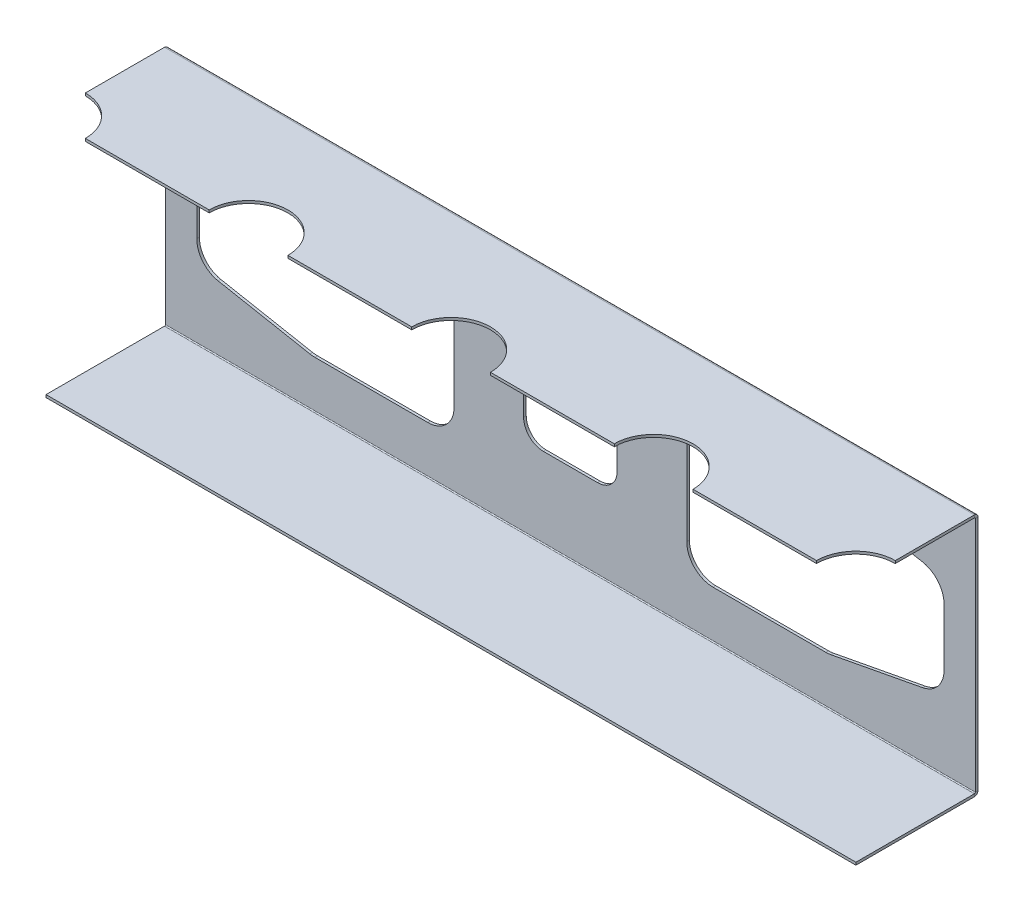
ISO-10303-21;
HEADER;
FILE_DESCRIPTION(('STEP AP214'),'2;1');
FILE_NAME('part.step','',(''),(''),'','','');
FILE_SCHEMA(('AUTOMOTIVE_DESIGN { 1 0 10303 214 1 1 1 1 }'));
ENDSEC;
DATA;
#1=APPLICATION_CONTEXT('core data for automotive mechanical design processes');
#2=APPLICATION_PROTOCOL_DEFINITION('international standard','automotive_design',2000,#1);
#3=PRODUCT_CONTEXT('',#1,'mechanical');
#4=PRODUCT('Part','Part','',(#3));
#5=PRODUCT_RELATED_PRODUCT_CATEGORY('part','',(#4));
#6=PRODUCT_DEFINITION_FORMATION('','',#4);
#7=PRODUCT_DEFINITION_CONTEXT('part definition',#1,'design');
#8=PRODUCT_DEFINITION('design','',#6,#7);
#9=PRODUCT_DEFINITION_SHAPE('','',#8);
#10=(LENGTH_UNIT() NAMED_UNIT(*) SI_UNIT(.MILLI.,.METRE.));
#11=(NAMED_UNIT(*) PLANE_ANGLE_UNIT() SI_UNIT($,.RADIAN.));
#12=(NAMED_UNIT(*) SI_UNIT($,.STERADIAN.) SOLID_ANGLE_UNIT());
#13=UNCERTAINTY_MEASURE_WITH_UNIT(LENGTH_MEASURE(1.E-05),#10,'distance_accuracy_value','');
#14=(GEOMETRIC_REPRESENTATION_CONTEXT(3) GLOBAL_UNCERTAINTY_ASSIGNED_CONTEXT((#13)) GLOBAL_UNIT_ASSIGNED_CONTEXT((#10,
#11,#12)) REPRESENTATION_CONTEXT('',''));
#15=CARTESIAN_POINT('',(0.,0.,0.));
#16=DIRECTION('',(0.,0.,1.));
#17=DIRECTION('',(1.,0.,0.));
#18=AXIS2_PLACEMENT_3D('',#15,#16,#17);
#19=CARTESIAN_POINT('',(308.5,93.0000000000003,93.));
#20=DIRECTION('',(0.,-1.,0.));
#21=DIRECTION('',(0.,0.,-1.));
#22=AXIS2_PLACEMENT_3D('',#19,#20,#21);
#23=PLANE('',#22);
#24=CARTESIAN_POINT('',(-308.5,93.0000000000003,93.));
#25=DIRECTION('',(0.,-1.,0.));
#26=DIRECTION('',(0.,0.,-1.));
#27=AXIS2_PLACEMENT_3D('',#24,#25,#26);
#28=CIRCLE('',#27,30.);
#29=CARTESIAN_POINT('',(-278.5,93.0000000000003,93.));
#30=VERTEX_POINT('',#29);
#31=CARTESIAN_POINT('',(-308.5,93.0000000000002,63.));
#32=VERTEX_POINT('',#31);
#33=EDGE_CURVE('E47',#30,#32,#28,.F.);
#34=ORIENTED_EDGE('',*,*,#33,.F.);
#35=DIRECTION('',(1.,0.,0.));
#36=VECTOR('',#35,1.);
#37=CARTESIAN_POINT('',(308.5,93.0000000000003,93.));
#38=LINE('',#37,#36);
#39=CARTESIAN_POINT('',(-184.2,93.0000000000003,93.));
#40=VERTEX_POINT('',#39);
#41=EDGE_CURVE('E397',#30,#40,#38,.T.);
#42=ORIENTED_EDGE('',*,*,#41,.T.);
#43=CARTESIAN_POINT('',(-154.2,93.0000000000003,93.));
#44=DIRECTION('',(0.,-1.,0.));
#45=DIRECTION('',(0.,0.,-1.));
#46=AXIS2_PLACEMENT_3D('',#43,#44,#45);
#47=CIRCLE('',#46,30.);
#48=CARTESIAN_POINT('',(-124.2,93.0000000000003,93.));
#49=VERTEX_POINT('',#48);
#50=EDGE_CURVE('E790',#49,#40,#47,.F.);
#51=ORIENTED_EDGE('',*,*,#50,.F.);
#52=CARTESIAN_POINT('',(-29.8999999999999,93.0000000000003,93.));
#53=VERTEX_POINT('',#52);
#54=EDGE_CURVE('E400',#49,#53,#38,.T.);
#55=ORIENTED_EDGE('',*,*,#54,.T.);
#56=CARTESIAN_POINT('',(0.100000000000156,93.0000000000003,93.));
#57=DIRECTION('',(0.,-1.,0.));
#58=DIRECTION('',(0.,0.,-1.));
#59=AXIS2_PLACEMENT_3D('',#56,#57,#58);
#60=CIRCLE('',#59,30.);
#61=CARTESIAN_POINT('',(30.1000000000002,93.0000000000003,93.));
#62=VERTEX_POINT('',#61);
#63=EDGE_CURVE('E800',#62,#53,#60,.F.);
#64=ORIENTED_EDGE('',*,*,#63,.F.);
#65=CARTESIAN_POINT('',(124.4,93.0000000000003,93.));
#66=VERTEX_POINT('',#65);
#67=EDGE_CURVE('E851',#62,#66,#38,.T.);
#68=ORIENTED_EDGE('',*,*,#67,.T.);
#69=CARTESIAN_POINT('',(154.4,93.0000000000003,93.));
#70=DIRECTION('',(0.,-1.,0.));
#71=DIRECTION('',(0.,0.,-1.));
#72=AXIS2_PLACEMENT_3D('',#69,#70,#71);
#73=CIRCLE('',#72,30.);
#74=CARTESIAN_POINT('',(184.4,93.0000000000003,93.));
#75=VERTEX_POINT('',#74);
#76=EDGE_CURVE('E810',#75,#66,#73,.F.);
#77=ORIENTED_EDGE('',*,*,#76,.F.);
#78=CARTESIAN_POINT('',(278.5,93.0000000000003,93.));
#79=VERTEX_POINT('',#78);
#80=EDGE_CURVE('E396',#75,#79,#38,.T.);
#81=ORIENTED_EDGE('',*,*,#80,.T.);
#82=CARTESIAN_POINT('',(308.5,93.0000000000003,93.));
#83=DIRECTION('',(0.,-1.,0.));
#84=DIRECTION('',(0.,0.,-1.));
#85=AXIS2_PLACEMENT_3D('',#82,#83,#84);
#86=CIRCLE('',#85,30.);
#87=CARTESIAN_POINT('',(308.5,93.0000000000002,63.));
#88=VERTEX_POINT('',#87);
#89=EDGE_CURVE('E819',#88,#79,#86,.F.);
#90=ORIENTED_EDGE('',*,*,#89,.F.);
#91=DIRECTION('',(0.,0.,-1.));
#92=VECTOR('',#91,1.);
#93=CARTESIAN_POINT('',(308.5,93.,1.99999999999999));
#94=LINE('',#93,#92);
#95=CARTESIAN_POINT('',(308.5,93.,2.73659999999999));
#96=VERTEX_POINT('',#95);
#97=EDGE_CURVE('E391',#88,#96,#94,.T.);
#98=ORIENTED_EDGE('',*,*,#97,.T.);
#99=DIRECTION('',(1.,0.,0.));
#100=VECTOR('',#99,1.);
#101=CARTESIAN_POINT('',(308.5,93.,2.73659999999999));
#102=LINE('',#101,#100);
#103=CARTESIAN_POINT('',(-308.5,93.,2.73659999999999));
#104=VERTEX_POINT('',#103);
#105=EDGE_CURVE('E387',#104,#96,#102,.T.);
#106=ORIENTED_EDGE('',*,*,#105,.F.);
#107=DIRECTION('',(0.,0.,1.));
#108=VECTOR('',#107,1.);
#109=CARTESIAN_POINT('',(-308.5,93.0000000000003,93.));
#110=LINE('',#109,#108);
#111=EDGE_CURVE('E394',#104,#32,#110,.T.);
#112=ORIENTED_EDGE('',*,*,#111,.T.);
#113=EDGE_LOOP('',(#34,#42,#51,#55,#64,#68,#77,#81,#90,#98,#106,#112));
#114=FACE_BOUND('',#113,.T.);
#115=ADVANCED_FACE('F32',(#114),#23,.F.);
#116=CARTESIAN_POINT('',(308.5,91.0000000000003,93.));
#117=DIRECTION('',(0.,-1.,0.));
#118=DIRECTION('',(0.,0.,-1.));
#119=AXIS2_PLACEMENT_3D('',#116,#117,#118);
#120=PLANE('',#119);
#121=DIRECTION('',(1.,0.,0.));
#122=VECTOR('',#121,1.);
#123=CARTESIAN_POINT('',(308.5,91.0000000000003,93.));
#124=LINE('',#123,#122);
#125=CARTESIAN_POINT('',(-278.5,91.0000000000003,93.));
#126=VERTEX_POINT('',#125);
#127=CARTESIAN_POINT('',(-184.2,91.0000000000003,93.));
#128=VERTEX_POINT('',#127);
#129=EDGE_CURVE('E375',#126,#128,#124,.T.);
#130=ORIENTED_EDGE('',*,*,#129,.F.);
#131=CARTESIAN_POINT('',(-308.5,91.0000000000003,93.));
#132=DIRECTION('',(0.,-1.,0.));
#133=DIRECTION('',(0.,0.,-1.));
#134=AXIS2_PLACEMENT_3D('',#131,#132,#133);
#135=CIRCLE('',#134,30.);
#136=CARTESIAN_POINT('',(-308.5,91.0000000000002,63.));
#137=VERTEX_POINT('',#136);
#138=EDGE_CURVE('E360',#126,#137,#135,.F.);
#139=ORIENTED_EDGE('',*,*,#138,.T.);
#140=DIRECTION('',(0.,0.,1.));
#141=VECTOR('',#140,1.);
#142=CARTESIAN_POINT('',(-308.5,91.0000000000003,93.));
#143=LINE('',#142,#141);
#144=CARTESIAN_POINT('',(-308.5,91.,2.7366));
#145=VERTEX_POINT('',#144);
#146=EDGE_CURVE('E373',#145,#137,#143,.T.);
#147=ORIENTED_EDGE('',*,*,#146,.F.);
#148=DIRECTION('',(-1.,0.,0.));
#149=VECTOR('',#148,1.);
#150=CARTESIAN_POINT('',(308.5,91.,2.73660000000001));
#151=LINE('',#150,#149);
#152=CARTESIAN_POINT('',(308.5,91.,2.7366));
#153=VERTEX_POINT('',#152);
#154=EDGE_CURVE('E707',#153,#145,#151,.T.);
#155=ORIENTED_EDGE('',*,*,#154,.F.);
#156=DIRECTION('',(0.,0.,-1.));
#157=VECTOR('',#156,1.);
#158=CARTESIAN_POINT('',(308.5,91.,2.));
#159=LINE('',#158,#157);
#160=CARTESIAN_POINT('',(308.5,91.0000000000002,63.));
#161=VERTEX_POINT('',#160);
#162=EDGE_CURVE('E382',#161,#153,#159,.T.);
#163=ORIENTED_EDGE('',*,*,#162,.F.);
#164=CARTESIAN_POINT('',(308.5,91.0000000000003,93.));
#165=DIRECTION('',(0.,-1.,0.));
#166=DIRECTION('',(0.,0.,-1.));
#167=AXIS2_PLACEMENT_3D('',#164,#165,#166);
#168=CIRCLE('',#167,30.);
#169=CARTESIAN_POINT('',(278.5,91.0000000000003,93.));
#170=VERTEX_POINT('',#169);
#171=EDGE_CURVE('E55',#161,#170,#168,.F.);
#172=ORIENTED_EDGE('',*,*,#171,.T.);
#173=CARTESIAN_POINT('',(184.4,91.0000000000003,93.));
#174=VERTEX_POINT('',#173);
#175=EDGE_CURVE('E381',#174,#170,#124,.T.);
#176=ORIENTED_EDGE('',*,*,#175,.F.);
#177=CARTESIAN_POINT('',(154.4,91.0000000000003,93.));
#178=DIRECTION('',(0.,-1.,0.));
#179=DIRECTION('',(0.,0.,-1.));
#180=AXIS2_PLACEMENT_3D('',#177,#178,#179);
#181=CIRCLE('',#180,30.);
#182=CARTESIAN_POINT('',(124.4,91.0000000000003,93.));
#183=VERTEX_POINT('',#182);
#184=EDGE_CURVE('E813',#174,#183,#181,.F.);
#185=ORIENTED_EDGE('',*,*,#184,.T.);
#186=CARTESIAN_POINT('',(30.1000000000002,91.0000000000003,93.));
#187=VERTEX_POINT('',#186);
#188=EDGE_CURVE('E385',#187,#183,#124,.T.);
#189=ORIENTED_EDGE('',*,*,#188,.F.);
#190=CARTESIAN_POINT('',(0.100000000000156,91.0000000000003,93.));
#191=DIRECTION('',(0.,-1.,0.));
#192=DIRECTION('',(0.,0.,-1.));
#193=AXIS2_PLACEMENT_3D('',#190,#191,#192);
#194=CIRCLE('',#193,30.);
#195=CARTESIAN_POINT('',(-29.8999999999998,91.0000000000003,93.));
#196=VERTEX_POINT('',#195);
#197=EDGE_CURVE('E803',#187,#196,#194,.F.);
#198=ORIENTED_EDGE('',*,*,#197,.T.);
#199=CARTESIAN_POINT('',(-124.2,91.0000000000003,93.));
#200=VERTEX_POINT('',#199);
#201=EDGE_CURVE('E392',#200,#196,#124,.T.);
#202=ORIENTED_EDGE('',*,*,#201,.F.);
#203=CARTESIAN_POINT('',(-154.2,91.0000000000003,93.));
#204=DIRECTION('',(0.,-1.,0.));
#205=DIRECTION('',(0.,0.,-1.));
#206=AXIS2_PLACEMENT_3D('',#203,#204,#205);
#207=CIRCLE('',#206,30.);
#208=EDGE_CURVE('E794',#200,#128,#207,.F.);
#209=ORIENTED_EDGE('',*,*,#208,.T.);
#210=EDGE_LOOP('',(#130,#139,#147,#155,#163,#172,#176,#185,#189,#198,#202,#209));
#211=FACE_BOUND('',#210,.T.);
#212=ADVANCED_FACE('F371',(#211),#120,.T.);
#213=CARTESIAN_POINT('',(308.5,93.0000000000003,93.));
#214=DIRECTION('',(0.,0.,-1.));
#215=DIRECTION('',(0.,1.,0.));
#216=AXIS2_PLACEMENT_3D('',#213,#214,#215);
#217=PLANE('',#216);
#218=DIRECTION('',(0.,-1.,0.));
#219=VECTOR('',#218,1.);
#220=CARTESIAN_POINT('',(-278.5,91.0000000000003,93.));
#221=LINE('',#220,#219);
#222=EDGE_CURVE('E366',#126,#30,#221,.F.);
#223=ORIENTED_EDGE('',*,*,#222,.F.);
#224=ORIENTED_EDGE('',*,*,#129,.T.);
#225=DIRECTION('',(0.,-1.,0.));
#226=VECTOR('',#225,1.);
#227=CARTESIAN_POINT('',(-184.2,91.0000000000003,93.));
#228=LINE('',#227,#226);
#229=EDGE_CURVE('E787',#128,#40,#228,.F.);
#230=ORIENTED_EDGE('',*,*,#229,.T.);
#231=ORIENTED_EDGE('',*,*,#41,.F.);
#232=EDGE_LOOP('',(#223,#224,#230,#231));
#233=FACE_BOUND('',#232,.T.);
#234=ADVANCED_FACE('F827',(#233),#217,.F.);
#235=CARTESIAN_POINT('',(-308.5,93.0000000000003,93.));
#236=DIRECTION('',(1.,0.,0.));
#237=DIRECTION('',(0.,0.,-1.));
#238=AXIS2_PLACEMENT_3D('',#235,#236,#237);
#239=PLANE('',#238);
#240=DIRECTION('',(0.,-1.,0.));
#241=VECTOR('',#240,1.);
#242=CARTESIAN_POINT('',(-308.5,91.0000000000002,63.));
#243=LINE('',#242,#241);
#244=EDGE_CURVE('E357',#137,#32,#243,.F.);
#245=ORIENTED_EDGE('',*,*,#244,.T.);
#246=ORIENTED_EDGE('',*,*,#111,.F.);
#247=DIRECTION('',(0.,1.,0.));
#248=VECTOR('',#247,1.);
#249=CARTESIAN_POINT('',(-308.5,91.,2.73659999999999));
#250=LINE('',#249,#248);
#251=EDGE_CURVE('E380',#145,#104,#250,.T.);
#252=ORIENTED_EDGE('',*,*,#251,.F.);
#253=ORIENTED_EDGE('',*,*,#146,.T.);
#254=EDGE_LOOP('',(#245,#246,#252,#253));
#255=FACE_BOUND('',#254,.T.);
#256=ADVANCED_FACE('F378',(#255),#239,.F.);
#257=DIRECTION('',(0.,-1.,0.));
#258=VECTOR('',#257,1.);
#259=CARTESIAN_POINT('',(278.5,91.0000000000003,93.));
#260=LINE('',#259,#258);
#261=EDGE_CURVE('E816',#170,#79,#260,.F.);
#262=ORIENTED_EDGE('',*,*,#261,.T.);
#263=ORIENTED_EDGE('',*,*,#80,.F.);
#264=DIRECTION('',(0.,-1.,0.));
#265=VECTOR('',#264,1.);
#266=CARTESIAN_POINT('',(184.4,91.0000000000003,93.));
#267=LINE('',#266,#265);
#268=EDGE_CURVE('E806',#174,#75,#267,.F.);
#269=ORIENTED_EDGE('',*,*,#268,.F.);
#270=ORIENTED_EDGE('',*,*,#175,.T.);
#271=EDGE_LOOP('',(#262,#263,#269,#270));
#272=FACE_BOUND('',#271,.T.);
#273=ADVANCED_FACE('F848',(#272),#217,.F.);
#274=CARTESIAN_POINT('',(308.5,93.,1.99999999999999));
#275=DIRECTION('',(-1.,0.,0.));
#276=DIRECTION('',(0.,0.,1.));
#277=AXIS2_PLACEMENT_3D('',#274,#275,#276);
#278=PLANE('',#277);
#279=DIRECTION('',(0.,-1.,0.));
#280=VECTOR('',#279,1.);
#281=CARTESIAN_POINT('',(308.5,91.0000000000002,63.));
#282=LINE('',#281,#280);
#283=EDGE_CURVE('E727',#161,#88,#282,.F.);
#284=ORIENTED_EDGE('',*,*,#283,.F.);
#285=ORIENTED_EDGE('',*,*,#162,.T.);
#286=DIRECTION('',(0.,1.,0.));
#287=VECTOR('',#286,1.);
#288=CARTESIAN_POINT('',(308.5,91.,2.73660000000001));
#289=LINE('',#288,#287);
#290=EDGE_CURVE('E704',#153,#96,#289,.T.);
#291=ORIENTED_EDGE('',*,*,#290,.T.);
#292=ORIENTED_EDGE('',*,*,#97,.F.);
#293=EDGE_LOOP('',(#284,#285,#291,#292));
#294=FACE_BOUND('',#293,.T.);
#295=ADVANCED_FACE('F725',(#294),#278,.F.);
#296=DIRECTION('',(0.,-1.,0.));
#297=VECTOR('',#296,1.);
#298=CARTESIAN_POINT('',(124.4,91.0000000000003,93.));
#299=LINE('',#298,#297);
#300=EDGE_CURVE('E807',#183,#66,#299,.F.);
#301=ORIENTED_EDGE('',*,*,#300,.T.);
#302=ORIENTED_EDGE('',*,*,#67,.F.);
#303=DIRECTION('',(0.,-1.,0.));
#304=VECTOR('',#303,1.);
#305=CARTESIAN_POINT('',(30.1000000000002,91.0000000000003,93.));
#306=LINE('',#305,#304);
#307=EDGE_CURVE('E796',#187,#62,#306,.F.);
#308=ORIENTED_EDGE('',*,*,#307,.F.);
#309=ORIENTED_EDGE('',*,*,#188,.T.);
#310=EDGE_LOOP('',(#301,#302,#308,#309));
#311=FACE_BOUND('',#310,.T.);
#312=ADVANCED_FACE('F839',(#311),#217,.F.);
#313=DIRECTION('',(0.,-1.,0.));
#314=VECTOR('',#313,1.);
#315=CARTESIAN_POINT('',(-29.8999999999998,91.0000000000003,93.));
#316=LINE('',#315,#314);
#317=EDGE_CURVE('E797',#196,#53,#316,.F.);
#318=ORIENTED_EDGE('',*,*,#317,.T.);
#319=ORIENTED_EDGE('',*,*,#54,.F.);
#320=DIRECTION('',(0.,-1.,0.));
#321=VECTOR('',#320,1.);
#322=CARTESIAN_POINT('',(-124.2,91.0000000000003,93.));
#323=LINE('',#322,#321);
#324=EDGE_CURVE('E784',#200,#49,#323,.F.);
#325=ORIENTED_EDGE('',*,*,#324,.F.);
#326=ORIENTED_EDGE('',*,*,#201,.T.);
#327=EDGE_LOOP('',(#318,#319,#325,#326));
#328=FACE_BOUND('',#327,.T.);
#329=ADVANCED_FACE('F855',(#328),#217,.F.);
#330=CARTESIAN_POINT('',(-308.5,-91.,2.));
#331=DIRECTION('',(0.,0.,1.));
#332=DIRECTION('',(1.,0.,0.));
#333=AXIS2_PLACEMENT_3D('',#330,#331,#332);
#334=PLANE('',#333);
#335=DIRECTION('',(0.,1.,0.));
#336=VECTOR('',#335,1.);
#337=CARTESIAN_POINT('',(-88.6500000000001,35.,2.));
#338=LINE('',#337,#336);
#339=CARTESIAN_POINT('',(-88.65,-35.,2.));
#340=VERTEX_POINT('',#339);
#341=CARTESIAN_POINT('',(-88.6500000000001,35.,2.));
#342=VERTEX_POINT('',#341);
#343=EDGE_CURVE('E549',#340,#342,#338,.T.);
#344=ORIENTED_EDGE('',*,*,#343,.F.);
#345=CARTESIAN_POINT('',(-108.65,-35.,2.));
#346=DIRECTION('',(0.,0.,1.));
#347=DIRECTION('',(1.,0.,0.));
#348=AXIS2_PLACEMENT_3D('',#345,#346,#347);
#349=CIRCLE('',#348,20.);
#350=CARTESIAN_POINT('',(-108.65,-55.,2.));
#351=VERTEX_POINT('',#350);
#352=EDGE_CURVE('E547',#351,#340,#349,.T.);
#353=ORIENTED_EDGE('',*,*,#352,.F.);
#354=DIRECTION('',(1.,0.,0.));
#355=VECTOR('',#354,1.);
#356=CARTESIAN_POINT('',(-108.65,-55.,2.));
#357=LINE('',#356,#355);
#358=CARTESIAN_POINT('',(-194.65,-55.,2.));
#359=VERTEX_POINT('',#358);
#360=EDGE_CURVE('E570',#359,#351,#357,.T.);
#361=ORIENTED_EDGE('',*,*,#360,.F.);
#362=CARTESIAN_POINT('',(-194.65,-35.,2.));
#363=DIRECTION('',(0.,0.,1.));
#364=DIRECTION('',(1.,0.,0.));
#365=AXIS2_PLACEMENT_3D('',#362,#363,#364);
#366=CIRCLE('',#365,20.);
#367=CARTESIAN_POINT('',(-198.363332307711,-54.6522559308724,2.));
#368=VERTEX_POINT('',#367);
#369=EDGE_CURVE('E567',#368,#359,#366,.T.);
#370=ORIENTED_EDGE('',*,*,#369,.F.);
#371=DIRECTION('',(0.982612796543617,-0.18566661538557,0.));
#372=VECTOR('',#371,1.);
#373=CARTESIAN_POINT('',(-198.363332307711,-54.6522559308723,2.));
#374=LINE('',#373,#372);
#375=CARTESIAN_POINT('',(-268.363332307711,-41.425618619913,2.));
#376=VERTEX_POINT('',#375);
#377=EDGE_CURVE('E565',#376,#368,#374,.T.);
#378=ORIENTED_EDGE('',*,*,#377,.F.);
#379=CARTESIAN_POINT('',(-264.65,-21.7733626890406,2.));
#380=DIRECTION('',(0.,0.,1.));
#381=DIRECTION('',(1.,0.,0.));
#382=AXIS2_PLACEMENT_3D('',#379,#380,#381);
#383=CIRCLE('',#382,20.);
#384=CARTESIAN_POINT('',(-284.65,-21.7733626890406,2.));
#385=VERTEX_POINT('',#384);
#386=EDGE_CURVE('E563',#385,#376,#383,.T.);
#387=ORIENTED_EDGE('',*,*,#386,.F.);
#388=DIRECTION('',(0.,-1.,0.));
#389=VECTOR('',#388,1.);
#390=CARTESIAN_POINT('',(-284.65,-21.7733626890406,2.));
#391=LINE('',#390,#389);
#392=CARTESIAN_POINT('',(-284.65,21.7733626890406,2.));
#393=VERTEX_POINT('',#392);
#394=EDGE_CURVE('E561',#393,#385,#391,.T.);
#395=ORIENTED_EDGE('',*,*,#394,.F.);
#396=CARTESIAN_POINT('',(-264.65,21.7733626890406,2.));
#397=DIRECTION('',(0.,0.,1.));
#398=DIRECTION('',(-1.,0.,0.));
#399=AXIS2_PLACEMENT_3D('',#396,#397,#398);
#400=CIRCLE('',#399,20.);
#401=CARTESIAN_POINT('',(-268.363332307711,41.425618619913,2.));
#402=VERTEX_POINT('',#401);
#403=EDGE_CURVE('E559',#402,#393,#400,.T.);
#404=ORIENTED_EDGE('',*,*,#403,.F.);
#405=DIRECTION('',(-0.982612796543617,-0.18566661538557,0.));
#406=VECTOR('',#405,1.);
#407=CARTESIAN_POINT('',(-198.363332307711,54.6522559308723,2.));
#408=LINE('',#407,#406);
#409=CARTESIAN_POINT('',(-198.363332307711,54.6522559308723,2.));
#410=VERTEX_POINT('',#409);
#411=EDGE_CURVE('E557',#410,#402,#408,.T.);
#412=ORIENTED_EDGE('',*,*,#411,.F.);
#413=CARTESIAN_POINT('',(-194.65,35.,2.));
#414=DIRECTION('',(0.,0.,1.));
#415=DIRECTION('',(-1.,0.,0.));
#416=AXIS2_PLACEMENT_3D('',#413,#414,#415);
#417=CIRCLE('',#416,20.);
#418=CARTESIAN_POINT('',(-194.65,55.,2.));
#419=VERTEX_POINT('',#418);
#420=EDGE_CURVE('E555',#419,#410,#417,.T.);
#421=ORIENTED_EDGE('',*,*,#420,.F.);
#422=DIRECTION('',(-1.,0.,0.));
#423=VECTOR('',#422,1.);
#424=CARTESIAN_POINT('',(-108.65,55.,2.));
#425=LINE('',#424,#423);
#426=CARTESIAN_POINT('',(-108.65,55.,2.));
#427=VERTEX_POINT('',#426);
#428=EDGE_CURVE('E553',#427,#419,#425,.T.);
#429=ORIENTED_EDGE('',*,*,#428,.F.);
#430=CARTESIAN_POINT('',(-108.65,35.,2.));
#431=DIRECTION('',(0.,0.,1.));
#432=DIRECTION('',(-1.,0.,0.));
#433=AXIS2_PLACEMENT_3D('',#430,#431,#432);
#434=CIRCLE('',#433,20.);
#435=EDGE_CURVE('E551',#342,#427,#434,.T.);
#436=ORIENTED_EDGE('',*,*,#435,.F.);
#437=EDGE_LOOP('',(#344,#353,#361,#370,#378,#387,#395,#404,#412,#421,#429,#436));
#438=FACE_BOUND('',#437,.T.);
#439=DIRECTION('',(1.,0.,0.));
#440=VECTOR('',#439,1.);
#441=CARTESIAN_POINT('',(20.65,-30.,2.));
#442=LINE('',#441,#440);
#443=CARTESIAN_POINT('',(-20.65,-30.,2.));
#444=VERTEX_POINT('',#443);
#445=CARTESIAN_POINT('',(20.65,-30.,2.));
#446=VERTEX_POINT('',#445);
#447=EDGE_CURVE('E624',#444,#446,#442,.T.);
#448=ORIENTED_EDGE('',*,*,#447,.F.);
#449=CARTESIAN_POINT('',(-20.65,-15.,2.));
#450=DIRECTION('',(0.,0.,1.));
#451=DIRECTION('',(1.,0.,0.));
#452=AXIS2_PLACEMENT_3D('',#449,#450,#451);
#453=CIRCLE('',#452,15.);
#454=CARTESIAN_POINT('',(-35.65,-15.,2.));
#455=VERTEX_POINT('',#454);
#456=EDGE_CURVE('E622',#455,#444,#453,.T.);
#457=ORIENTED_EDGE('',*,*,#456,.F.);
#458=DIRECTION('',(0.,-1.,0.));
#459=VECTOR('',#458,1.);
#460=CARTESIAN_POINT('',(-35.65,-15.,2.));
#461=LINE('',#460,#459);
#462=CARTESIAN_POINT('',(-35.6500000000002,15.,2.));
#463=VERTEX_POINT('',#462);
#464=EDGE_CURVE('E637',#463,#455,#461,.T.);
#465=ORIENTED_EDGE('',*,*,#464,.F.);
#466=CARTESIAN_POINT('',(-20.6500000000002,15.,2.));
#467=DIRECTION('',(0.,0.,1.));
#468=DIRECTION('',(-1.,0.,0.));
#469=AXIS2_PLACEMENT_3D('',#466,#467,#468);
#470=CIRCLE('',#469,15.);
#471=CARTESIAN_POINT('',(-20.6500000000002,30.,2.));
#472=VERTEX_POINT('',#471);
#473=EDGE_CURVE('E634',#472,#463,#470,.T.);
#474=ORIENTED_EDGE('',*,*,#473,.F.);
#475=DIRECTION('',(-1.,0.,0.));
#476=VECTOR('',#475,1.);
#477=CARTESIAN_POINT('',(20.6500000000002,30.,2.));
#478=LINE('',#477,#476);
#479=CARTESIAN_POINT('',(20.6500000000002,30.,2.));
#480=VERTEX_POINT('',#479);
#481=EDGE_CURVE('E632',#480,#472,#478,.T.);
#482=ORIENTED_EDGE('',*,*,#481,.F.);
#483=CARTESIAN_POINT('',(20.6500000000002,15.,2.));
#484=DIRECTION('',(0.,0.,1.));
#485=DIRECTION('',(1.,0.,0.));
#486=AXIS2_PLACEMENT_3D('',#483,#484,#485);
#487=CIRCLE('',#486,15.);
#488=CARTESIAN_POINT('',(35.6500000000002,15.,2.));
#489=VERTEX_POINT('',#488);
#490=EDGE_CURVE('E630',#489,#480,#487,.T.);
#491=ORIENTED_EDGE('',*,*,#490,.F.);
#492=DIRECTION('',(0.,1.,0.));
#493=VECTOR('',#492,1.);
#494=CARTESIAN_POINT('',(35.65,-15.,2.));
#495=LINE('',#494,#493);
#496=CARTESIAN_POINT('',(35.65,-15.,2.));
#497=VERTEX_POINT('',#496);
#498=EDGE_CURVE('E628',#497,#489,#495,.T.);
#499=ORIENTED_EDGE('',*,*,#498,.F.);
#500=CARTESIAN_POINT('',(20.65,-15.,2.));
#501=DIRECTION('',(0.,0.,1.));
#502=DIRECTION('',(-1.,0.,0.));
#503=AXIS2_PLACEMENT_3D('',#500,#501,#502);
#504=CIRCLE('',#503,15.);
#505=EDGE_CURVE('E626',#446,#497,#504,.T.);
#506=ORIENTED_EDGE('',*,*,#505,.F.);
#507=EDGE_LOOP('',(#448,#457,#465,#474,#482,#491,#499,#506));
#508=FACE_BOUND('',#507,.T.);
#509=DIRECTION('',(0.,-1.,0.));
#510=VECTOR('',#509,1.);
#511=CARTESIAN_POINT('',(88.6500000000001,35.,2.));
#512=LINE('',#511,#510);
#513=CARTESIAN_POINT('',(88.6500000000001,35.,2.));
#514=VERTEX_POINT('',#513);
#515=CARTESIAN_POINT('',(88.65,-35.,2.));
#516=VERTEX_POINT('',#515);
#517=EDGE_CURVE('E462',#514,#516,#512,.T.);
#518=ORIENTED_EDGE('',*,*,#517,.F.);
#519=CARTESIAN_POINT('',(108.65,35.,2.));
#520=DIRECTION('',(0.,0.,1.));
#521=DIRECTION('',(1.,0.,0.));
#522=AXIS2_PLACEMENT_3D('',#519,#520,#521);
#523=CIRCLE('',#522,20.);
#524=CARTESIAN_POINT('',(108.65,55.,2.));
#525=VERTEX_POINT('',#524);
#526=EDGE_CURVE('E460',#525,#514,#523,.T.);
#527=ORIENTED_EDGE('',*,*,#526,.F.);
#528=DIRECTION('',(-1.,0.,0.));
#529=VECTOR('',#528,1.);
#530=CARTESIAN_POINT('',(108.65,55.,2.));
#531=LINE('',#530,#529);
#532=CARTESIAN_POINT('',(194.65,55.,2.));
#533=VERTEX_POINT('',#532);
#534=EDGE_CURVE('E483',#533,#525,#531,.T.);
#535=ORIENTED_EDGE('',*,*,#534,.F.);
#536=CARTESIAN_POINT('',(194.65,35.,2.));
#537=DIRECTION('',(0.,0.,1.));
#538=DIRECTION('',(1.,0.,0.));
#539=AXIS2_PLACEMENT_3D('',#536,#537,#538);
#540=CIRCLE('',#539,20.);
#541=CARTESIAN_POINT('',(198.363332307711,54.6522559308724,2.));
#542=VERTEX_POINT('',#541);
#543=EDGE_CURVE('E480',#542,#533,#540,.T.);
#544=ORIENTED_EDGE('',*,*,#543,.F.);
#545=DIRECTION('',(-0.982612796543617,0.18566661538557,0.));
#546=VECTOR('',#545,1.);
#547=CARTESIAN_POINT('',(198.363332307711,54.6522559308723,2.));
#548=LINE('',#547,#546);
#549=CARTESIAN_POINT('',(268.363332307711,41.425618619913,2.));
#550=VERTEX_POINT('',#549);
#551=EDGE_CURVE('E478',#550,#542,#548,.T.);
#552=ORIENTED_EDGE('',*,*,#551,.F.);
#553=CARTESIAN_POINT('',(264.65,21.7733626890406,2.));
#554=DIRECTION('',(0.,0.,1.));
#555=DIRECTION('',(1.,0.,0.));
#556=AXIS2_PLACEMENT_3D('',#553,#554,#555);
#557=CIRCLE('',#556,20.);
#558=CARTESIAN_POINT('',(284.65,21.7733626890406,2.));
#559=VERTEX_POINT('',#558);
#560=EDGE_CURVE('E476',#559,#550,#557,.T.);
#561=ORIENTED_EDGE('',*,*,#560,.F.);
#562=DIRECTION('',(0.,1.,0.));
#563=VECTOR('',#562,1.);
#564=CARTESIAN_POINT('',(284.65,-21.7733626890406,2.));
#565=LINE('',#564,#563);
#566=CARTESIAN_POINT('',(284.65,-21.7733626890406,2.));
#567=VERTEX_POINT('',#566);
#568=EDGE_CURVE('E474',#567,#559,#565,.T.);
#569=ORIENTED_EDGE('',*,*,#568,.F.);
#570=CARTESIAN_POINT('',(264.65,-21.7733626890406,2.));
#571=DIRECTION('',(0.,0.,1.));
#572=DIRECTION('',(-1.,0.,0.));
#573=AXIS2_PLACEMENT_3D('',#570,#571,#572);
#574=CIRCLE('',#573,20.);
#575=CARTESIAN_POINT('',(268.363332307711,-41.425618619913,2.));
#576=VERTEX_POINT('',#575);
#577=EDGE_CURVE('E472',#576,#567,#574,.T.);
#578=ORIENTED_EDGE('',*,*,#577,.F.);
#579=DIRECTION('',(0.982612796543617,0.18566661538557,0.));
#580=VECTOR('',#579,1.);
#581=CARTESIAN_POINT('',(198.363332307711,-54.6522559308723,2.));
#582=LINE('',#581,#580);
#583=CARTESIAN_POINT('',(198.363332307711,-54.6522559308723,2.));
#584=VERTEX_POINT('',#583);
#585=EDGE_CURVE('E470',#584,#576,#582,.T.);
#586=ORIENTED_EDGE('',*,*,#585,.F.);
#587=CARTESIAN_POINT('',(194.65,-35.,2.));
#588=DIRECTION('',(0.,0.,1.));
#589=DIRECTION('',(-1.,0.,0.));
#590=AXIS2_PLACEMENT_3D('',#587,#588,#589);
#591=CIRCLE('',#590,20.);
#592=CARTESIAN_POINT('',(194.65,-55.,2.));
#593=VERTEX_POINT('',#592);
#594=EDGE_CURVE('E468',#593,#584,#591,.T.);
#595=ORIENTED_EDGE('',*,*,#594,.F.);
#596=DIRECTION('',(1.,0.,0.));
#597=VECTOR('',#596,1.);
#598=CARTESIAN_POINT('',(108.65,-55.,2.));
#599=LINE('',#598,#597);
#600=CARTESIAN_POINT('',(108.65,-55.,2.));
#601=VERTEX_POINT('',#600);
#602=EDGE_CURVE('E466',#601,#593,#599,.T.);
#603=ORIENTED_EDGE('',*,*,#602,.F.);
#604=CARTESIAN_POINT('',(108.65,-35.,2.));
#605=DIRECTION('',(0.,0.,1.));
#606=DIRECTION('',(-1.,0.,0.));
#607=AXIS2_PLACEMENT_3D('',#604,#605,#606);
#608=CIRCLE('',#607,20.);
#609=EDGE_CURVE('E464',#516,#601,#608,.T.);
#610=ORIENTED_EDGE('',*,*,#609,.F.);
#611=EDGE_LOOP('',(#518,#527,#535,#544,#552,#561,#569,#578,#586,#595,#603,#610));
#612=FACE_BOUND('',#611,.T.);
#613=DIRECTION('',(0.,-1.,0.));
#614=VECTOR('',#613,1.);
#615=CARTESIAN_POINT('',(-308.5,91.,2.));
#616=LINE('',#615,#614);
#617=CARTESIAN_POINT('',(-308.5,90.2634,2.));
#618=VERTEX_POINT('',#617);
#619=CARTESIAN_POINT('',(-308.5,-90.2634,2.));
#620=VERTEX_POINT('',#619);
#621=EDGE_CURVE('E40',#618,#620,#616,.T.);
#622=ORIENTED_EDGE('',*,*,#621,.T.);
#623=DIRECTION('',(1.,0.,0.));
#624=VECTOR('',#623,1.);
#625=CARTESIAN_POINT('',(308.5,-90.2634,2.00000000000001));
#626=LINE('',#625,#624);
#627=CARTESIAN_POINT('',(308.5,-90.2634,2.00000000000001));
#628=VERTEX_POINT('',#627);
#629=EDGE_CURVE('E667',#628,#620,#626,.F.);
#630=ORIENTED_EDGE('',*,*,#629,.F.);
#631=DIRECTION('',(0.,1.,0.));
#632=VECTOR('',#631,1.);
#633=CARTESIAN_POINT('',(308.5,91.,2.));
#634=LINE('',#633,#632);
#635=CARTESIAN_POINT('',(308.5,90.2634,2.));
#636=VERTEX_POINT('',#635);
#637=EDGE_CURVE('E11',#628,#636,#634,.T.);
#638=ORIENTED_EDGE('',*,*,#637,.T.);
#639=DIRECTION('',(-1.,0.,0.));
#640=VECTOR('',#639,1.);
#641=CARTESIAN_POINT('',(-308.5,90.2634,2.));
#642=LINE('',#641,#640);
#643=EDGE_CURVE('E405',#618,#636,#642,.F.);
#644=ORIENTED_EDGE('',*,*,#643,.F.);
#645=EDGE_LOOP('',(#622,#630,#638,#644));
#646=FACE_BOUND('',#645,.T.);
#647=ADVANCED_FACE('F666',(#438,#508,#612,#646),#334,.T.);
#648=CARTESIAN_POINT('',(-308.5,-91.,0.));
#649=DIRECTION('',(0.,0.,1.));
#650=DIRECTION('',(1.,0.,0.));
#651=AXIS2_PLACEMENT_3D('',#648,#649,#650);
#652=PLANE('',#651);
#653=CARTESIAN_POINT('',(-108.65,-35.,0.));
#654=DIRECTION('',(0.,0.,1.));
#655=DIRECTION('',(1.,0.,0.));
#656=AXIS2_PLACEMENT_3D('',#653,#654,#655);
#657=CIRCLE('',#656,20.);
#658=CARTESIAN_POINT('',(-108.65,-55.,0.));
#659=VERTEX_POINT('',#658);
#660=CARTESIAN_POINT('',(-88.65,-35.,0.));
#661=VERTEX_POINT('',#660);
#662=EDGE_CURVE('E511',#659,#661,#657,.T.);
#663=ORIENTED_EDGE('',*,*,#662,.T.);
#664=DIRECTION('',(0.,1.,0.));
#665=VECTOR('',#664,1.);
#666=CARTESIAN_POINT('',(-88.6500000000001,35.,0.));
#667=LINE('',#666,#665);
#668=CARTESIAN_POINT('',(-88.6500000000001,35.,0.));
#669=VERTEX_POINT('',#668);
#670=EDGE_CURVE('E514',#661,#669,#667,.T.);
#671=ORIENTED_EDGE('',*,*,#670,.T.);
#672=CARTESIAN_POINT('',(-108.65,35.,0.));
#673=DIRECTION('',(0.,0.,1.));
#674=DIRECTION('',(-1.,0.,0.));
#675=AXIS2_PLACEMENT_3D('',#672,#673,#674);
#676=CIRCLE('',#675,20.);
#677=CARTESIAN_POINT('',(-108.65,55.,0.));
#678=VERTEX_POINT('',#677);
#679=EDGE_CURVE('E517',#669,#678,#676,.T.);
#680=ORIENTED_EDGE('',*,*,#679,.T.);
#681=DIRECTION('',(-1.,0.,0.));
#682=VECTOR('',#681,1.);
#683=CARTESIAN_POINT('',(-108.65,55.,0.));
#684=LINE('',#683,#682);
#685=CARTESIAN_POINT('',(-194.65,55.,0.));
#686=VERTEX_POINT('',#685);
#687=EDGE_CURVE('E520',#678,#686,#684,.T.);
#688=ORIENTED_EDGE('',*,*,#687,.T.);
#689=CARTESIAN_POINT('',(-194.65,35.,0.));
#690=DIRECTION('',(0.,0.,1.));
#691=DIRECTION('',(-1.,0.,0.));
#692=AXIS2_PLACEMENT_3D('',#689,#690,#691);
#693=CIRCLE('',#692,20.);
#694=CARTESIAN_POINT('',(-198.363332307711,54.6522559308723,0.));
#695=VERTEX_POINT('',#694);
#696=EDGE_CURVE('E523',#686,#695,#693,.T.);
#697=ORIENTED_EDGE('',*,*,#696,.T.);
#698=DIRECTION('',(-0.982612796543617,-0.18566661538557,0.));
#699=VECTOR('',#698,1.);
#700=CARTESIAN_POINT('',(-198.363332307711,54.6522559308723,0.));
#701=LINE('',#700,#699);
#702=CARTESIAN_POINT('',(-268.363332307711,41.425618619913,0.));
#703=VERTEX_POINT('',#702);
#704=EDGE_CURVE('E526',#695,#703,#701,.T.);
#705=ORIENTED_EDGE('',*,*,#704,.T.);
#706=CARTESIAN_POINT('',(-264.65,21.7733626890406,0.));
#707=DIRECTION('',(0.,0.,1.));
#708=DIRECTION('',(-1.,0.,0.));
#709=AXIS2_PLACEMENT_3D('',#706,#707,#708);
#710=CIRCLE('',#709,20.);
#711=CARTESIAN_POINT('',(-284.65,21.7733626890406,0.));
#712=VERTEX_POINT('',#711);
#713=EDGE_CURVE('E529',#703,#712,#710,.T.);
#714=ORIENTED_EDGE('',*,*,#713,.T.);
#715=DIRECTION('',(0.,-1.,0.));
#716=VECTOR('',#715,1.);
#717=CARTESIAN_POINT('',(-284.65,-21.7733626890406,0.));
#718=LINE('',#717,#716);
#719=CARTESIAN_POINT('',(-284.65,-21.7733626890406,0.));
#720=VERTEX_POINT('',#719);
#721=EDGE_CURVE('E532',#712,#720,#718,.T.);
#722=ORIENTED_EDGE('',*,*,#721,.T.);
#723=CARTESIAN_POINT('',(-264.65,-21.7733626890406,0.));
#724=DIRECTION('',(0.,0.,1.));
#725=DIRECTION('',(1.,0.,0.));
#726=AXIS2_PLACEMENT_3D('',#723,#724,#725);
#727=CIRCLE('',#726,20.);
#728=CARTESIAN_POINT('',(-268.363332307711,-41.425618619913,0.));
#729=VERTEX_POINT('',#728);
#730=EDGE_CURVE('E535',#720,#729,#727,.T.);
#731=ORIENTED_EDGE('',*,*,#730,.T.);
#732=DIRECTION('',(0.982612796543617,-0.18566661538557,0.));
#733=VECTOR('',#732,1.);
#734=CARTESIAN_POINT('',(-198.363332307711,-54.6522559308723,0.));
#735=LINE('',#734,#733);
#736=CARTESIAN_POINT('',(-198.363332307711,-54.6522559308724,0.));
#737=VERTEX_POINT('',#736);
#738=EDGE_CURVE('E538',#729,#737,#735,.T.);
#739=ORIENTED_EDGE('',*,*,#738,.T.);
#740=CARTESIAN_POINT('',(-194.65,-35.,0.));
#741=DIRECTION('',(0.,0.,1.));
#742=DIRECTION('',(1.,0.,0.));
#743=AXIS2_PLACEMENT_3D('',#740,#741,#742);
#744=CIRCLE('',#743,20.);
#745=CARTESIAN_POINT('',(-194.65,-55.,0.));
#746=VERTEX_POINT('',#745);
#747=EDGE_CURVE('E541',#737,#746,#744,.T.);
#748=ORIENTED_EDGE('',*,*,#747,.T.);
#749=DIRECTION('',(1.,0.,0.));
#750=VECTOR('',#749,1.);
#751=CARTESIAN_POINT('',(-108.65,-55.,0.));
#752=LINE('',#751,#750);
#753=EDGE_CURVE('E544',#746,#659,#752,.T.);
#754=ORIENTED_EDGE('',*,*,#753,.T.);
#755=EDGE_LOOP('',(#663,#671,#680,#688,#697,#705,#714,#722,#731,#739,#748,#754));
#756=FACE_BOUND('',#755,.T.);
#757=CARTESIAN_POINT('',(-20.65,-15.,0.));
#758=DIRECTION('',(0.,0.,1.));
#759=DIRECTION('',(1.,0.,0.));
#760=AXIS2_PLACEMENT_3D('',#757,#758,#759);
#761=CIRCLE('',#760,15.);
#762=CARTESIAN_POINT('',(-35.65,-15.,0.));
#763=VERTEX_POINT('',#762);
#764=CARTESIAN_POINT('',(-20.65,-30.,0.));
#765=VERTEX_POINT('',#764);
#766=EDGE_CURVE('E598',#763,#765,#761,.T.);
#767=ORIENTED_EDGE('',*,*,#766,.T.);
#768=DIRECTION('',(1.,0.,0.));
#769=VECTOR('',#768,1.);
#770=CARTESIAN_POINT('',(20.65,-30.,0.));
#771=LINE('',#770,#769);
#772=CARTESIAN_POINT('',(20.65,-30.,0.));
#773=VERTEX_POINT('',#772);
#774=EDGE_CURVE('E601',#765,#773,#771,.T.);
#775=ORIENTED_EDGE('',*,*,#774,.T.);
#776=CARTESIAN_POINT('',(20.65,-15.,0.));
#777=DIRECTION('',(0.,0.,1.));
#778=DIRECTION('',(-1.,0.,0.));
#779=AXIS2_PLACEMENT_3D('',#776,#777,#778);
#780=CIRCLE('',#779,15.);
#781=CARTESIAN_POINT('',(35.65,-15.,0.));
#782=VERTEX_POINT('',#781);
#783=EDGE_CURVE('E604',#773,#782,#780,.T.);
#784=ORIENTED_EDGE('',*,*,#783,.T.);
#785=DIRECTION('',(0.,1.,0.));
#786=VECTOR('',#785,1.);
#787=CARTESIAN_POINT('',(35.65,-15.,0.));
#788=LINE('',#787,#786);
#789=CARTESIAN_POINT('',(35.6500000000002,15.,0.));
#790=VERTEX_POINT('',#789);
#791=EDGE_CURVE('E607',#782,#790,#788,.T.);
#792=ORIENTED_EDGE('',*,*,#791,.T.);
#793=CARTESIAN_POINT('',(20.6500000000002,15.,0.));
#794=DIRECTION('',(0.,0.,1.));
#795=DIRECTION('',(1.,0.,0.));
#796=AXIS2_PLACEMENT_3D('',#793,#794,#795);
#797=CIRCLE('',#796,15.);
#798=CARTESIAN_POINT('',(20.6500000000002,30.,0.));
#799=VERTEX_POINT('',#798);
#800=EDGE_CURVE('E610',#790,#799,#797,.T.);
#801=ORIENTED_EDGE('',*,*,#800,.T.);
#802=DIRECTION('',(-1.,0.,0.));
#803=VECTOR('',#802,1.);
#804=CARTESIAN_POINT('',(20.6500000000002,30.,0.));
#805=LINE('',#804,#803);
#806=CARTESIAN_POINT('',(-20.6500000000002,30.,0.));
#807=VERTEX_POINT('',#806);
#808=EDGE_CURVE('E613',#799,#807,#805,.T.);
#809=ORIENTED_EDGE('',*,*,#808,.T.);
#810=CARTESIAN_POINT('',(-20.6500000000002,15.,0.));
#811=DIRECTION('',(0.,0.,1.));
#812=DIRECTION('',(-1.,0.,0.));
#813=AXIS2_PLACEMENT_3D('',#810,#811,#812);
#814=CIRCLE('',#813,15.);
#815=CARTESIAN_POINT('',(-35.6500000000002,15.,0.));
#816=VERTEX_POINT('',#815);
#817=EDGE_CURVE('E616',#807,#816,#814,.T.);
#818=ORIENTED_EDGE('',*,*,#817,.T.);
#819=DIRECTION('',(0.,-1.,0.));
#820=VECTOR('',#819,1.);
#821=CARTESIAN_POINT('',(-35.65,-15.,0.));
#822=LINE('',#821,#820);
#823=EDGE_CURVE('E619',#816,#763,#822,.T.);
#824=ORIENTED_EDGE('',*,*,#823,.T.);
#825=EDGE_LOOP('',(#767,#775,#784,#792,#801,#809,#818,#824));
#826=FACE_BOUND('',#825,.T.);
#827=CARTESIAN_POINT('',(108.65,35.,0.));
#828=DIRECTION('',(0.,0.,1.));
#829=DIRECTION('',(1.,0.,0.));
#830=AXIS2_PLACEMENT_3D('',#827,#828,#829);
#831=CIRCLE('',#830,20.);
#832=CARTESIAN_POINT('',(108.65,55.,0.));
#833=VERTEX_POINT('',#832);
#834=CARTESIAN_POINT('',(88.6500000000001,35.,0.));
#835=VERTEX_POINT('',#834);
#836=EDGE_CURVE('E422',#833,#835,#831,.T.);
#837=ORIENTED_EDGE('',*,*,#836,.T.);
#838=DIRECTION('',(0.,-1.,0.));
#839=VECTOR('',#838,1.);
#840=CARTESIAN_POINT('',(88.6500000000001,35.,0.));
#841=LINE('',#840,#839);
#842=CARTESIAN_POINT('',(88.65,-35.,0.));
#843=VERTEX_POINT('',#842);
#844=EDGE_CURVE('E427',#835,#843,#841,.T.);
#845=ORIENTED_EDGE('',*,*,#844,.T.);
#846=CARTESIAN_POINT('',(108.65,-35.,0.));
#847=DIRECTION('',(0.,0.,1.));
#848=DIRECTION('',(-1.,0.,0.));
#849=AXIS2_PLACEMENT_3D('',#846,#847,#848);
#850=CIRCLE('',#849,20.);
#851=CARTESIAN_POINT('',(108.65,-55.,0.));
#852=VERTEX_POINT('',#851);
#853=EDGE_CURVE('E430',#843,#852,#850,.T.);
#854=ORIENTED_EDGE('',*,*,#853,.T.);
#855=DIRECTION('',(1.,0.,0.));
#856=VECTOR('',#855,1.);
#857=CARTESIAN_POINT('',(108.65,-55.,0.));
#858=LINE('',#857,#856);
#859=CARTESIAN_POINT('',(194.65,-55.,0.));
#860=VERTEX_POINT('',#859);
#861=EDGE_CURVE('E433',#852,#860,#858,.T.);
#862=ORIENTED_EDGE('',*,*,#861,.T.);
#863=CARTESIAN_POINT('',(194.65,-35.,0.));
#864=DIRECTION('',(0.,0.,1.));
#865=DIRECTION('',(-1.,0.,0.));
#866=AXIS2_PLACEMENT_3D('',#863,#864,#865);
#867=CIRCLE('',#866,20.);
#868=CARTESIAN_POINT('',(198.363332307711,-54.6522559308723,0.));
#869=VERTEX_POINT('',#868);
#870=EDGE_CURVE('E436',#860,#869,#867,.T.);
#871=ORIENTED_EDGE('',*,*,#870,.T.);
#872=DIRECTION('',(0.982612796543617,0.18566661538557,0.));
#873=VECTOR('',#872,1.);
#874=CARTESIAN_POINT('',(198.363332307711,-54.6522559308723,0.));
#875=LINE('',#874,#873);
#876=CARTESIAN_POINT('',(268.363332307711,-41.425618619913,0.));
#877=VERTEX_POINT('',#876);
#878=EDGE_CURVE('E439',#869,#877,#875,.T.);
#879=ORIENTED_EDGE('',*,*,#878,.T.);
#880=CARTESIAN_POINT('',(264.65,-21.7733626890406,0.));
#881=DIRECTION('',(0.,0.,1.));
#882=DIRECTION('',(-1.,0.,0.));
#883=AXIS2_PLACEMENT_3D('',#880,#881,#882);
#884=CIRCLE('',#883,20.);
#885=CARTESIAN_POINT('',(284.65,-21.7733626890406,0.));
#886=VERTEX_POINT('',#885);
#887=EDGE_CURVE('E442',#877,#886,#884,.T.);
#888=ORIENTED_EDGE('',*,*,#887,.T.);
#889=DIRECTION('',(0.,1.,0.));
#890=VECTOR('',#889,1.);
#891=CARTESIAN_POINT('',(284.65,-21.7733626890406,0.));
#892=LINE('',#891,#890);
#893=CARTESIAN_POINT('',(284.65,21.7733626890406,0.));
#894=VERTEX_POINT('',#893);
#895=EDGE_CURVE('E445',#886,#894,#892,.T.);
#896=ORIENTED_EDGE('',*,*,#895,.T.);
#897=CARTESIAN_POINT('',(264.65,21.7733626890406,0.));
#898=DIRECTION('',(0.,0.,1.));
#899=DIRECTION('',(1.,0.,0.));
#900=AXIS2_PLACEMENT_3D('',#897,#898,#899);
#901=CIRCLE('',#900,20.);
#902=CARTESIAN_POINT('',(268.363332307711,41.425618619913,0.));
#903=VERTEX_POINT('',#902);
#904=EDGE_CURVE('E448',#894,#903,#901,.T.);
#905=ORIENTED_EDGE('',*,*,#904,.T.);
#906=DIRECTION('',(-0.982612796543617,0.18566661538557,0.));
#907=VECTOR('',#906,1.);
#908=CARTESIAN_POINT('',(198.363332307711,54.6522559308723,0.));
#909=LINE('',#908,#907);
#910=CARTESIAN_POINT('',(198.363332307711,54.6522559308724,0.));
#911=VERTEX_POINT('',#910);
#912=EDGE_CURVE('E451',#903,#911,#909,.T.);
#913=ORIENTED_EDGE('',*,*,#912,.T.);
#914=CARTESIAN_POINT('',(194.65,35.,0.));
#915=DIRECTION('',(0.,0.,1.));
#916=DIRECTION('',(1.,0.,0.));
#917=AXIS2_PLACEMENT_3D('',#914,#915,#916);
#918=CIRCLE('',#917,20.);
#919=CARTESIAN_POINT('',(194.65,55.,0.));
#920=VERTEX_POINT('',#919);
#921=EDGE_CURVE('E454',#911,#920,#918,.T.);
#922=ORIENTED_EDGE('',*,*,#921,.T.);
#923=DIRECTION('',(-1.,0.,0.));
#924=VECTOR('',#923,1.);
#925=CARTESIAN_POINT('',(108.65,55.,0.));
#926=LINE('',#925,#924);
#927=EDGE_CURVE('E457',#920,#833,#926,.T.);
#928=ORIENTED_EDGE('',*,*,#927,.T.);
#929=EDGE_LOOP('',(#837,#845,#854,#862,#871,#879,#888,#896,#905,#913,#922,#928));
#930=FACE_BOUND('',#929,.T.);
#931=DIRECTION('',(1.,0.,0.));
#932=VECTOR('',#931,1.);
#933=CARTESIAN_POINT('',(308.5,-90.2634,0.));
#934=LINE('',#933,#932);
#935=CARTESIAN_POINT('',(308.5,-90.2634,0.));
#936=VERTEX_POINT('',#935);
#937=CARTESIAN_POINT('',(-308.5,-90.2634,0.));
#938=VERTEX_POINT('',#937);
#939=EDGE_CURVE('E692',#936,#938,#934,.F.);
#940=ORIENTED_EDGE('',*,*,#939,.T.);
#941=DIRECTION('',(0.,-1.,0.));
#942=VECTOR('',#941,1.);
#943=CARTESIAN_POINT('',(-308.5,91.,0.));
#944=LINE('',#943,#942);
#945=CARTESIAN_POINT('',(-308.5,90.2634,0.));
#946=VERTEX_POINT('',#945);
#947=EDGE_CURVE('E657',#946,#938,#944,.T.);
#948=ORIENTED_EDGE('',*,*,#947,.F.);
#949=DIRECTION('',(-1.,0.,0.));
#950=VECTOR('',#949,1.);
#951=CARTESIAN_POINT('',(-308.5,90.2634,0.));
#952=LINE('',#951,#950);
#953=CARTESIAN_POINT('',(308.5,90.2634,0.));
#954=VERTEX_POINT('',#953);
#955=EDGE_CURVE('E410',#946,#954,#952,.F.);
#956=ORIENTED_EDGE('',*,*,#955,.T.);
#957=DIRECTION('',(0.,1.,0.));
#958=VECTOR('',#957,1.);
#959=CARTESIAN_POINT('',(308.5,91.,0.));
#960=LINE('',#959,#958);
#961=EDGE_CURVE('E660',#936,#954,#960,.T.);
#962=ORIENTED_EDGE('',*,*,#961,.F.);
#963=EDGE_LOOP('',(#940,#948,#956,#962));
#964=FACE_BOUND('',#963,.T.);
#965=ADVANCED_FACE('F735',(#756,#826,#930,#964),#652,.F.);
#966=CARTESIAN_POINT('',(-308.5,91.,2.));
#967=DIRECTION('',(1.,0.,0.));
#968=DIRECTION('',(0.,0.,-1.));
#969=AXIS2_PLACEMENT_3D('',#966,#967,#968);
#970=PLANE('',#969);
#971=DIRECTION('',(0.,0.,-1.));
#972=VECTOR('',#971,1.);
#973=CARTESIAN_POINT('',(-308.5,-90.2634,2.00000000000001));
#974=LINE('',#973,#972);
#975=EDGE_CURVE('E685',#620,#938,#974,.T.);
#976=ORIENTED_EDGE('',*,*,#975,.F.);
#977=ORIENTED_EDGE('',*,*,#621,.F.);
#978=DIRECTION('',(0.,0.,-1.));
#979=VECTOR('',#978,1.);
#980=CARTESIAN_POINT('',(-308.5,90.2634,2.));
#981=LINE('',#980,#979);
#982=EDGE_CURVE('E416',#618,#946,#981,.T.);
#983=ORIENTED_EDGE('',*,*,#982,.T.);
#984=ORIENTED_EDGE('',*,*,#947,.T.);
#985=EDGE_LOOP('',(#976,#977,#983,#984));
#986=FACE_BOUND('',#985,.T.);
#987=ADVANCED_FACE('F34',(#986),#970,.F.);
#988=CARTESIAN_POINT('',(308.5,91.,2.));
#989=DIRECTION('',(-1.,0.,0.));
#990=DIRECTION('',(0.,0.,1.));
#991=AXIS2_PLACEMENT_3D('',#988,#989,#990);
#992=PLANE('',#991);
#993=DIRECTION('',(0.,0.,-1.));
#994=VECTOR('',#993,1.);
#995=CARTESIAN_POINT('',(308.5,-90.2634,2.00000000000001));
#996=LINE('',#995,#994);
#997=EDGE_CURVE('E701',#628,#936,#996,.T.);
#998=ORIENTED_EDGE('',*,*,#997,.T.);
#999=ORIENTED_EDGE('',*,*,#961,.T.);
#1000=DIRECTION('',(0.,0.,-1.));
#1001=VECTOR('',#1000,1.);
#1002=CARTESIAN_POINT('',(308.5,90.2634,2.));
#1003=LINE('',#1002,#1001);
#1004=EDGE_CURVE('E419',#636,#954,#1003,.T.);
#1005=ORIENTED_EDGE('',*,*,#1004,.F.);
#1006=ORIENTED_EDGE('',*,*,#637,.F.);
#1007=EDGE_LOOP('',(#998,#999,#1005,#1006));
#1008=FACE_BOUND('',#1007,.T.);
#1009=ADVANCED_FACE('F1016',(#1008),#992,.F.);
#1010=CARTESIAN_POINT('',(-20.65,-15.,2.));
#1011=DIRECTION('',(0.,0.,-1.));
#1012=DIRECTION('',(-1.,0.,0.));
#1013=AXIS2_PLACEMENT_3D('',#1010,#1011,#1012);
#1014=CYLINDRICAL_SURFACE('',#1013,15.);
#1015=ORIENTED_EDGE('',*,*,#766,.F.);
#1016=DIRECTION('',(0.,0.,-1.));
#1017=VECTOR('',#1016,1.);
#1018=CARTESIAN_POINT('',(-35.65,-15.,2.));
#1019=LINE('',#1018,#1017);
#1020=EDGE_CURVE('E639',#455,#763,#1019,.T.);
#1021=ORIENTED_EDGE('',*,*,#1020,.F.);
#1022=ORIENTED_EDGE('',*,*,#456,.T.);
#1023=DIRECTION('',(0.,0.,-1.));
#1024=VECTOR('',#1023,1.);
#1025=CARTESIAN_POINT('',(-20.65,-30.,2.));
#1026=LINE('',#1025,#1024);
#1027=EDGE_CURVE('E654',#444,#765,#1026,.T.);
#1028=ORIENTED_EDGE('',*,*,#1027,.T.);
#1029=EDGE_LOOP('',(#1015,#1021,#1022,#1028));
#1030=FACE_BOUND('',#1029,.T.);
#1031=ADVANCED_FACE('F1012',(#1030),#1014,.F.);
#1032=CARTESIAN_POINT('',(20.65,-30.,2.));
#1033=DIRECTION('',(0.,1.,0.));
#1034=DIRECTION('',(0.,0.,1.));
#1035=AXIS2_PLACEMENT_3D('',#1032,#1033,#1034);
#1036=PLANE('',#1035);
#1037=ORIENTED_EDGE('',*,*,#774,.F.);
#1038=ORIENTED_EDGE('',*,*,#1027,.F.);
#1039=ORIENTED_EDGE('',*,*,#447,.T.);
#1040=DIRECTION('',(0.,0.,-1.));
#1041=VECTOR('',#1040,1.);
#1042=CARTESIAN_POINT('',(20.65,-30.,2.));
#1043=LINE('',#1042,#1041);
#1044=EDGE_CURVE('E652',#446,#773,#1043,.T.);
#1045=ORIENTED_EDGE('',*,*,#1044,.T.);
#1046=EDGE_LOOP('',(#1037,#1038,#1039,#1045));
#1047=FACE_BOUND('',#1046,.T.);
#1048=ADVANCED_FACE('F1008',(#1047),#1036,.T.);
#1049=CARTESIAN_POINT('',(20.65,-15.,2.));
#1050=DIRECTION('',(0.,0.,-1.));
#1051=DIRECTION('',(-1.,0.,0.));
#1052=AXIS2_PLACEMENT_3D('',#1049,#1050,#1051);
#1053=CYLINDRICAL_SURFACE('',#1052,15.);
#1054=ORIENTED_EDGE('',*,*,#783,.F.);
#1055=ORIENTED_EDGE('',*,*,#1044,.F.);
#1056=ORIENTED_EDGE('',*,*,#505,.T.);
#1057=DIRECTION('',(0.,0.,-1.));
#1058=VECTOR('',#1057,1.);
#1059=CARTESIAN_POINT('',(35.65,-15.,2.));
#1060=LINE('',#1059,#1058);
#1061=EDGE_CURVE('E650',#497,#782,#1060,.T.);
#1062=ORIENTED_EDGE('',*,*,#1061,.T.);
#1063=EDGE_LOOP('',(#1054,#1055,#1056,#1062));
#1064=FACE_BOUND('',#1063,.T.);
#1065=ADVANCED_FACE('F1004',(#1064),#1053,.F.);
#1066=CARTESIAN_POINT('',(35.65,-15.,2.));
#1067=DIRECTION('',(-1.,0.,0.));
#1068=DIRECTION('',(0.,-1.,0.));
#1069=AXIS2_PLACEMENT_3D('',#1066,#1067,#1068);
#1070=PLANE('',#1069);
#1071=ORIENTED_EDGE('',*,*,#791,.F.);
#1072=ORIENTED_EDGE('',*,*,#1061,.F.);
#1073=ORIENTED_EDGE('',*,*,#498,.T.);
#1074=DIRECTION('',(0.,0.,-1.));
#1075=VECTOR('',#1074,1.);
#1076=CARTESIAN_POINT('',(35.6500000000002,15.,2.));
#1077=LINE('',#1076,#1075);
#1078=EDGE_CURVE('E648',#489,#790,#1077,.T.);
#1079=ORIENTED_EDGE('',*,*,#1078,.T.);
#1080=EDGE_LOOP('',(#1071,#1072,#1073,#1079));
#1081=FACE_BOUND('',#1080,.T.);
#1082=ADVANCED_FACE('F1000',(#1081),#1070,.T.);
#1083=CARTESIAN_POINT('',(20.6500000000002,15.,2.));
#1084=DIRECTION('',(0.,0.,-1.));
#1085=DIRECTION('',(-1.,0.,0.));
#1086=AXIS2_PLACEMENT_3D('',#1083,#1084,#1085);
#1087=CYLINDRICAL_SURFACE('',#1086,15.);
#1088=ORIENTED_EDGE('',*,*,#800,.F.);
#1089=ORIENTED_EDGE('',*,*,#1078,.F.);
#1090=ORIENTED_EDGE('',*,*,#490,.T.);
#1091=DIRECTION('',(0.,0.,-1.));
#1092=VECTOR('',#1091,1.);
#1093=CARTESIAN_POINT('',(20.6500000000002,30.,2.));
#1094=LINE('',#1093,#1092);
#1095=EDGE_CURVE('E646',#480,#799,#1094,.T.);
#1096=ORIENTED_EDGE('',*,*,#1095,.T.);
#1097=EDGE_LOOP('',(#1088,#1089,#1090,#1096));
#1098=FACE_BOUND('',#1097,.T.);
#1099=ADVANCED_FACE('F996',(#1098),#1087,.F.);
#1100=CARTESIAN_POINT('',(20.6500000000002,30.,2.));
#1101=DIRECTION('',(0.,-1.,0.));
#1102=DIRECTION('',(0.,0.,-1.));
#1103=AXIS2_PLACEMENT_3D('',#1100,#1101,#1102);
#1104=PLANE('',#1103);
#1105=ORIENTED_EDGE('',*,*,#808,.F.);
#1106=ORIENTED_EDGE('',*,*,#1095,.F.);
#1107=ORIENTED_EDGE('',*,*,#481,.T.);
#1108=DIRECTION('',(0.,0.,-1.));
#1109=VECTOR('',#1108,1.);
#1110=CARTESIAN_POINT('',(-20.6500000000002,30.,2.));
#1111=LINE('',#1110,#1109);
#1112=EDGE_CURVE('E644',#472,#807,#1111,.T.);
#1113=ORIENTED_EDGE('',*,*,#1112,.T.);
#1114=EDGE_LOOP('',(#1105,#1106,#1107,#1113));
#1115=FACE_BOUND('',#1114,.T.);
#1116=ADVANCED_FACE('F992',(#1115),#1104,.T.);
#1117=CARTESIAN_POINT('',(-20.6500000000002,15.,2.));
#1118=DIRECTION('',(0.,0.,-1.));
#1119=DIRECTION('',(-1.,0.,0.));
#1120=AXIS2_PLACEMENT_3D('',#1117,#1118,#1119);
#1121=CYLINDRICAL_SURFACE('',#1120,15.);
#1122=ORIENTED_EDGE('',*,*,#817,.F.);
#1123=ORIENTED_EDGE('',*,*,#1112,.F.);
#1124=ORIENTED_EDGE('',*,*,#473,.T.);
#1125=DIRECTION('',(0.,0.,-1.));
#1126=VECTOR('',#1125,1.);
#1127=CARTESIAN_POINT('',(-35.6500000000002,15.,2.));
#1128=LINE('',#1127,#1126);
#1129=EDGE_CURVE('E642',#463,#816,#1128,.T.);
#1130=ORIENTED_EDGE('',*,*,#1129,.T.);
#1131=EDGE_LOOP('',(#1122,#1123,#1124,#1130));
#1132=FACE_BOUND('',#1131,.T.);
#1133=ADVANCED_FACE('F988',(#1132),#1121,.F.);
#1134=CARTESIAN_POINT('',(-35.65,-15.,2.));
#1135=DIRECTION('',(1.,0.,0.));
#1136=DIRECTION('',(0.,1.,0.));
#1137=AXIS2_PLACEMENT_3D('',#1134,#1135,#1136);
#1138=PLANE('',#1137);
#1139=ORIENTED_EDGE('',*,*,#823,.F.);
#1140=ORIENTED_EDGE('',*,*,#1129,.F.);
#1141=ORIENTED_EDGE('',*,*,#464,.T.);
#1142=ORIENTED_EDGE('',*,*,#1020,.T.);
#1143=EDGE_LOOP('',(#1139,#1140,#1141,#1142));
#1144=FACE_BOUND('',#1143,.T.);
#1145=ADVANCED_FACE('F984',(#1144),#1138,.T.);
#1146=CARTESIAN_POINT('',(-108.65,-35.,2.));
#1147=DIRECTION('',(0.,0.,-1.));
#1148=DIRECTION('',(-1.,0.,0.));
#1149=AXIS2_PLACEMENT_3D('',#1146,#1147,#1148);
#1150=CYLINDRICAL_SURFACE('',#1149,20.);
#1151=ORIENTED_EDGE('',*,*,#662,.F.);
#1152=DIRECTION('',(0.,0.,-1.));
#1153=VECTOR('',#1152,1.);
#1154=CARTESIAN_POINT('',(-108.65,-55.,2.));
#1155=LINE('',#1154,#1153);
#1156=EDGE_CURVE('E572',#351,#659,#1155,.T.);
#1157=ORIENTED_EDGE('',*,*,#1156,.F.);
#1158=ORIENTED_EDGE('',*,*,#352,.T.);
#1159=DIRECTION('',(0.,0.,-1.));
#1160=VECTOR('',#1159,1.);
#1161=CARTESIAN_POINT('',(-88.65,-35.,2.));
#1162=LINE('',#1161,#1160);
#1163=EDGE_CURVE('E595',#340,#661,#1162,.T.);
#1164=ORIENTED_EDGE('',*,*,#1163,.T.);
#1165=EDGE_LOOP('',(#1151,#1157,#1158,#1164));
#1166=FACE_BOUND('',#1165,.T.);
#1167=ADVANCED_FACE('F980',(#1166),#1150,.F.);
#1168=CARTESIAN_POINT('',(-88.6500000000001,35.,2.));
#1169=DIRECTION('',(-1.,0.,0.));
#1170=DIRECTION('',(0.,-1.,0.));
#1171=AXIS2_PLACEMENT_3D('',#1168,#1169,#1170);
#1172=PLANE('',#1171);
#1173=ORIENTED_EDGE('',*,*,#670,.F.);
#1174=ORIENTED_EDGE('',*,*,#1163,.F.);
#1175=ORIENTED_EDGE('',*,*,#343,.T.);
#1176=DIRECTION('',(0.,0.,-1.));
#1177=VECTOR('',#1176,1.);
#1178=CARTESIAN_POINT('',(-88.6500000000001,35.,2.));
#1179=LINE('',#1178,#1177);
#1180=EDGE_CURVE('E593',#342,#669,#1179,.T.);
#1181=ORIENTED_EDGE('',*,*,#1180,.T.);
#1182=EDGE_LOOP('',(#1173,#1174,#1175,#1181));
#1183=FACE_BOUND('',#1182,.T.);
#1184=ADVANCED_FACE('F976',(#1183),#1172,.T.);
#1185=CARTESIAN_POINT('',(-108.65,35.,2.));
#1186=DIRECTION('',(0.,0.,-1.));
#1187=DIRECTION('',(-1.,0.,0.));
#1188=AXIS2_PLACEMENT_3D('',#1185,#1186,#1187);
#1189=CYLINDRICAL_SURFACE('',#1188,20.);
#1190=ORIENTED_EDGE('',*,*,#679,.F.);
#1191=ORIENTED_EDGE('',*,*,#1180,.F.);
#1192=ORIENTED_EDGE('',*,*,#435,.T.);
#1193=DIRECTION('',(0.,0.,-1.));
#1194=VECTOR('',#1193,1.);
#1195=CARTESIAN_POINT('',(-108.65,55.,2.));
#1196=LINE('',#1195,#1194);
#1197=EDGE_CURVE('E591',#427,#678,#1196,.T.);
#1198=ORIENTED_EDGE('',*,*,#1197,.T.);
#1199=EDGE_LOOP('',(#1190,#1191,#1192,#1198));
#1200=FACE_BOUND('',#1199,.T.);
#1201=ADVANCED_FACE('F972',(#1200),#1189,.F.);
#1202=CARTESIAN_POINT('',(-108.65,55.,2.));
#1203=DIRECTION('',(0.,-1.,0.));
#1204=DIRECTION('',(1.,0.,0.));
#1205=AXIS2_PLACEMENT_3D('',#1202,#1203,#1204);
#1206=PLANE('',#1205);
#1207=ORIENTED_EDGE('',*,*,#687,.F.);
#1208=ORIENTED_EDGE('',*,*,#1197,.F.);
#1209=ORIENTED_EDGE('',*,*,#428,.T.);
#1210=DIRECTION('',(0.,0.,-1.));
#1211=VECTOR('',#1210,1.);
#1212=CARTESIAN_POINT('',(-194.65,55.,2.));
#1213=LINE('',#1212,#1211);
#1214=EDGE_CURVE('E589',#419,#686,#1213,.T.);
#1215=ORIENTED_EDGE('',*,*,#1214,.T.);
#1216=EDGE_LOOP('',(#1207,#1208,#1209,#1215));
#1217=FACE_BOUND('',#1216,.T.);
#1218=ADVANCED_FACE('F968',(#1217),#1206,.T.);
#1219=CARTESIAN_POINT('',(-194.65,35.,2.));
#1220=DIRECTION('',(0.,0.,-1.));
#1221=DIRECTION('',(-1.,0.,0.));
#1222=AXIS2_PLACEMENT_3D('',#1219,#1220,#1221);
#1223=CYLINDRICAL_SURFACE('',#1222,20.);
#1224=ORIENTED_EDGE('',*,*,#696,.F.);
#1225=ORIENTED_EDGE('',*,*,#1214,.F.);
#1226=ORIENTED_EDGE('',*,*,#420,.T.);
#1227=DIRECTION('',(0.,0.,-1.));
#1228=VECTOR('',#1227,1.);
#1229=CARTESIAN_POINT('',(-198.363332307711,54.6522559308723,2.));
#1230=LINE('',#1229,#1228);
#1231=EDGE_CURVE('E587',#410,#695,#1230,.T.);
#1232=ORIENTED_EDGE('',*,*,#1231,.T.);
#1233=EDGE_LOOP('',(#1224,#1225,#1226,#1232));
#1234=FACE_BOUND('',#1233,.T.);
#1235=ADVANCED_FACE('F964',(#1234),#1223,.F.);
#1236=CARTESIAN_POINT('',(-198.363332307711,54.6522559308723,2.));
#1237=DIRECTION('',(0.18566661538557,-0.982612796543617,0.));
#1238=DIRECTION('',(0.982612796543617,0.18566661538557,0.));
#1239=AXIS2_PLACEMENT_3D('',#1236,#1237,#1238);
#1240=PLANE('',#1239);
#1241=ORIENTED_EDGE('',*,*,#704,.F.);
#1242=ORIENTED_EDGE('',*,*,#1231,.F.);
#1243=ORIENTED_EDGE('',*,*,#411,.T.);
#1244=DIRECTION('',(0.,0.,-1.));
#1245=VECTOR('',#1244,1.);
#1246=CARTESIAN_POINT('',(-268.363332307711,41.425618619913,2.));
#1247=LINE('',#1246,#1245);
#1248=EDGE_CURVE('E585',#402,#703,#1247,.T.);
#1249=ORIENTED_EDGE('',*,*,#1248,.T.);
#1250=EDGE_LOOP('',(#1241,#1242,#1243,#1249));
#1251=FACE_BOUND('',#1250,.T.);
#1252=ADVANCED_FACE('F960',(#1251),#1240,.T.);
#1253=CARTESIAN_POINT('',(-264.65,21.7733626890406,2.));
#1254=DIRECTION('',(0.,0.,-1.));
#1255=DIRECTION('',(-1.,0.,0.));
#1256=AXIS2_PLACEMENT_3D('',#1253,#1254,#1255);
#1257=CYLINDRICAL_SURFACE('',#1256,20.);
#1258=ORIENTED_EDGE('',*,*,#713,.F.);
#1259=ORIENTED_EDGE('',*,*,#1248,.F.);
#1260=ORIENTED_EDGE('',*,*,#403,.T.);
#1261=DIRECTION('',(0.,0.,-1.));
#1262=VECTOR('',#1261,1.);
#1263=CARTESIAN_POINT('',(-284.65,21.7733626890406,2.));
#1264=LINE('',#1263,#1262);
#1265=EDGE_CURVE('E583',#393,#712,#1264,.T.);
#1266=ORIENTED_EDGE('',*,*,#1265,.T.);
#1267=EDGE_LOOP('',(#1258,#1259,#1260,#1266));
#1268=FACE_BOUND('',#1267,.T.);
#1269=ADVANCED_FACE('F956',(#1268),#1257,.F.);
#1270=CARTESIAN_POINT('',(-284.65,-21.7733626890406,2.));
#1271=DIRECTION('',(1.,0.,0.));
#1272=DIRECTION('',(0.,0.,-1.));
#1273=AXIS2_PLACEMENT_3D('',#1270,#1271,#1272);
#1274=PLANE('',#1273);
#1275=ORIENTED_EDGE('',*,*,#721,.F.);
#1276=ORIENTED_EDGE('',*,*,#1265,.F.);
#1277=ORIENTED_EDGE('',*,*,#394,.T.);
#1278=DIRECTION('',(0.,0.,-1.));
#1279=VECTOR('',#1278,1.);
#1280=CARTESIAN_POINT('',(-284.65,-21.7733626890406,2.));
#1281=LINE('',#1280,#1279);
#1282=EDGE_CURVE('E581',#385,#720,#1281,.T.);
#1283=ORIENTED_EDGE('',*,*,#1282,.T.);
#1284=EDGE_LOOP('',(#1275,#1276,#1277,#1283));
#1285=FACE_BOUND('',#1284,.T.);
#1286=ADVANCED_FACE('F952',(#1285),#1274,.T.);
#1287=CARTESIAN_POINT('',(-264.65,-21.7733626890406,2.));
#1288=DIRECTION('',(0.,0.,-1.));
#1289=DIRECTION('',(-1.,0.,0.));
#1290=AXIS2_PLACEMENT_3D('',#1287,#1288,#1289);
#1291=CYLINDRICAL_SURFACE('',#1290,20.);
#1292=ORIENTED_EDGE('',*,*,#730,.F.);
#1293=ORIENTED_EDGE('',*,*,#1282,.F.);
#1294=ORIENTED_EDGE('',*,*,#386,.T.);
#1295=DIRECTION('',(0.,0.,-1.));
#1296=VECTOR('',#1295,1.);
#1297=CARTESIAN_POINT('',(-268.363332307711,-41.425618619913,2.));
#1298=LINE('',#1297,#1296);
#1299=EDGE_CURVE('E579',#376,#729,#1298,.T.);
#1300=ORIENTED_EDGE('',*,*,#1299,.T.);
#1301=EDGE_LOOP('',(#1292,#1293,#1294,#1300));
#1302=FACE_BOUND('',#1301,.T.);
#1303=ADVANCED_FACE('F948',(#1302),#1291,.F.);
#1304=CARTESIAN_POINT('',(-198.363332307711,-54.6522559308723,2.));
#1305=DIRECTION('',(0.18566661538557,0.982612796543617,0.));
#1306=DIRECTION('',(-0.982612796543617,0.18566661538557,0.));
#1307=AXIS2_PLACEMENT_3D('',#1304,#1305,#1306);
#1308=PLANE('',#1307);
#1309=ORIENTED_EDGE('',*,*,#738,.F.);
#1310=ORIENTED_EDGE('',*,*,#1299,.F.);
#1311=ORIENTED_EDGE('',*,*,#377,.T.);
#1312=DIRECTION('',(0.,0.,-1.));
#1313=VECTOR('',#1312,1.);
#1314=CARTESIAN_POINT('',(-198.363332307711,-54.6522559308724,2.));
#1315=LINE('',#1314,#1313);
#1316=EDGE_CURVE('E577',#368,#737,#1315,.T.);
#1317=ORIENTED_EDGE('',*,*,#1316,.T.);
#1318=EDGE_LOOP('',(#1309,#1310,#1311,#1317));
#1319=FACE_BOUND('',#1318,.T.);
#1320=ADVANCED_FACE('F944',(#1319),#1308,.T.);
#1321=CARTESIAN_POINT('',(-194.65,-35.,2.));
#1322=DIRECTION('',(0.,0.,-1.));
#1323=DIRECTION('',(-1.,0.,0.));
#1324=AXIS2_PLACEMENT_3D('',#1321,#1322,#1323);
#1325=CYLINDRICAL_SURFACE('',#1324,20.);
#1326=ORIENTED_EDGE('',*,*,#747,.F.);
#1327=ORIENTED_EDGE('',*,*,#1316,.F.);
#1328=ORIENTED_EDGE('',*,*,#369,.T.);
#1329=DIRECTION('',(0.,0.,-1.));
#1330=VECTOR('',#1329,1.);
#1331=CARTESIAN_POINT('',(-194.65,-55.,2.));
#1332=LINE('',#1331,#1330);
#1333=EDGE_CURVE('E575',#359,#746,#1332,.T.);
#1334=ORIENTED_EDGE('',*,*,#1333,.T.);
#1335=EDGE_LOOP('',(#1326,#1327,#1328,#1334));
#1336=FACE_BOUND('',#1335,.T.);
#1337=ADVANCED_FACE('F940',(#1336),#1325,.F.);
#1338=CARTESIAN_POINT('',(-108.65,-55.,2.));
#1339=DIRECTION('',(0.,1.,0.));
#1340=DIRECTION('',(-1.,0.,0.));
#1341=AXIS2_PLACEMENT_3D('',#1338,#1339,#1340);
#1342=PLANE('',#1341);
#1343=ORIENTED_EDGE('',*,*,#753,.F.);
#1344=ORIENTED_EDGE('',*,*,#1333,.F.);
#1345=ORIENTED_EDGE('',*,*,#360,.T.);
#1346=ORIENTED_EDGE('',*,*,#1156,.T.);
#1347=EDGE_LOOP('',(#1343,#1344,#1345,#1346));
#1348=FACE_BOUND('',#1347,.T.);
#1349=ADVANCED_FACE('F936',(#1348),#1342,.T.);
#1350=CARTESIAN_POINT('',(108.65,35.,2.));
#1351=DIRECTION('',(0.,0.,-1.));
#1352=DIRECTION('',(-1.,0.,0.));
#1353=AXIS2_PLACEMENT_3D('',#1350,#1351,#1352);
#1354=CYLINDRICAL_SURFACE('',#1353,20.);
#1355=ORIENTED_EDGE('',*,*,#836,.F.);
#1356=DIRECTION('',(0.,0.,-1.));
#1357=VECTOR('',#1356,1.);
#1358=CARTESIAN_POINT('',(108.65,55.,2.));
#1359=LINE('',#1358,#1357);
#1360=EDGE_CURVE('E485',#525,#833,#1359,.T.);
#1361=ORIENTED_EDGE('',*,*,#1360,.F.);
#1362=ORIENTED_EDGE('',*,*,#526,.T.);
#1363=DIRECTION('',(0.,0.,-1.));
#1364=VECTOR('',#1363,1.);
#1365=CARTESIAN_POINT('',(88.6500000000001,35.,2.));
#1366=LINE('',#1365,#1364);
#1367=EDGE_CURVE('E508',#514,#835,#1366,.T.);
#1368=ORIENTED_EDGE('',*,*,#1367,.T.);
#1369=EDGE_LOOP('',(#1355,#1361,#1362,#1368));
#1370=FACE_BOUND('',#1369,.T.);
#1371=ADVANCED_FACE('F932',(#1370),#1354,.F.);
#1372=CARTESIAN_POINT('',(88.6500000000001,35.,2.));
#1373=DIRECTION('',(1.,0.,0.));
#1374=DIRECTION('',(0.,1.,0.));
#1375=AXIS2_PLACEMENT_3D('',#1372,#1373,#1374);
#1376=PLANE('',#1375);
#1377=ORIENTED_EDGE('',*,*,#844,.F.);
#1378=ORIENTED_EDGE('',*,*,#1367,.F.);
#1379=ORIENTED_EDGE('',*,*,#517,.T.);
#1380=DIRECTION('',(0.,0.,-1.));
#1381=VECTOR('',#1380,1.);
#1382=CARTESIAN_POINT('',(88.65,-35.,2.));
#1383=LINE('',#1382,#1381);
#1384=EDGE_CURVE('E506',#516,#843,#1383,.T.);
#1385=ORIENTED_EDGE('',*,*,#1384,.T.);
#1386=EDGE_LOOP('',(#1377,#1378,#1379,#1385));
#1387=FACE_BOUND('',#1386,.T.);
#1388=ADVANCED_FACE('F928',(#1387),#1376,.T.);
#1389=CARTESIAN_POINT('',(108.65,-35.,2.));
#1390=DIRECTION('',(0.,0.,-1.));
#1391=DIRECTION('',(-1.,0.,0.));
#1392=AXIS2_PLACEMENT_3D('',#1389,#1390,#1391);
#1393=CYLINDRICAL_SURFACE('',#1392,20.);
#1394=ORIENTED_EDGE('',*,*,#853,.F.);
#1395=ORIENTED_EDGE('',*,*,#1384,.F.);
#1396=ORIENTED_EDGE('',*,*,#609,.T.);
#1397=DIRECTION('',(0.,0.,-1.));
#1398=VECTOR('',#1397,1.);
#1399=CARTESIAN_POINT('',(108.65,-55.,2.));
#1400=LINE('',#1399,#1398);
#1401=EDGE_CURVE('E504',#601,#852,#1400,.T.);
#1402=ORIENTED_EDGE('',*,*,#1401,.T.);
#1403=EDGE_LOOP('',(#1394,#1395,#1396,#1402));
#1404=FACE_BOUND('',#1403,.T.);
#1405=ADVANCED_FACE('F924',(#1404),#1393,.F.);
#1406=CARTESIAN_POINT('',(108.65,-55.,2.));
#1407=DIRECTION('',(0.,1.,0.));
#1408=DIRECTION('',(-1.,0.,0.));
#1409=AXIS2_PLACEMENT_3D('',#1406,#1407,#1408);
#1410=PLANE('',#1409);
#1411=ORIENTED_EDGE('',*,*,#861,.F.);
#1412=ORIENTED_EDGE('',*,*,#1401,.F.);
#1413=ORIENTED_EDGE('',*,*,#602,.T.);
#1414=DIRECTION('',(0.,0.,-1.));
#1415=VECTOR('',#1414,1.);
#1416=CARTESIAN_POINT('',(194.65,-55.,2.));
#1417=LINE('',#1416,#1415);
#1418=EDGE_CURVE('E502',#593,#860,#1417,.T.);
#1419=ORIENTED_EDGE('',*,*,#1418,.T.);
#1420=EDGE_LOOP('',(#1411,#1412,#1413,#1419));
#1421=FACE_BOUND('',#1420,.T.);
#1422=ADVANCED_FACE('F920',(#1421),#1410,.T.);
#1423=CARTESIAN_POINT('',(194.65,-35.,2.));
#1424=DIRECTION('',(0.,0.,-1.));
#1425=DIRECTION('',(-1.,0.,0.));
#1426=AXIS2_PLACEMENT_3D('',#1423,#1424,#1425);
#1427=CYLINDRICAL_SURFACE('',#1426,20.);
#1428=ORIENTED_EDGE('',*,*,#870,.F.);
#1429=ORIENTED_EDGE('',*,*,#1418,.F.);
#1430=ORIENTED_EDGE('',*,*,#594,.T.);
#1431=DIRECTION('',(0.,0.,-1.));
#1432=VECTOR('',#1431,1.);
#1433=CARTESIAN_POINT('',(198.363332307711,-54.6522559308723,2.));
#1434=LINE('',#1433,#1432);
#1435=EDGE_CURVE('E500',#584,#869,#1434,.T.);
#1436=ORIENTED_EDGE('',*,*,#1435,.T.);
#1437=EDGE_LOOP('',(#1428,#1429,#1430,#1436));
#1438=FACE_BOUND('',#1437,.T.);
#1439=ADVANCED_FACE('F916',(#1438),#1427,.F.);
#1440=CARTESIAN_POINT('',(198.363332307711,-54.6522559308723,2.));
#1441=DIRECTION('',(-0.18566661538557,0.982612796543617,0.));
#1442=DIRECTION('',(-0.982612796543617,-0.18566661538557,0.));
#1443=AXIS2_PLACEMENT_3D('',#1440,#1441,#1442);
#1444=PLANE('',#1443);
#1445=ORIENTED_EDGE('',*,*,#878,.F.);
#1446=ORIENTED_EDGE('',*,*,#1435,.F.);
#1447=ORIENTED_EDGE('',*,*,#585,.T.);
#1448=DIRECTION('',(0.,0.,-1.));
#1449=VECTOR('',#1448,1.);
#1450=CARTESIAN_POINT('',(268.363332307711,-41.425618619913,2.));
#1451=LINE('',#1450,#1449);
#1452=EDGE_CURVE('E498',#576,#877,#1451,.T.);
#1453=ORIENTED_EDGE('',*,*,#1452,.T.);
#1454=EDGE_LOOP('',(#1445,#1446,#1447,#1453));
#1455=FACE_BOUND('',#1454,.T.);
#1456=ADVANCED_FACE('F912',(#1455),#1444,.T.);
#1457=CARTESIAN_POINT('',(264.65,-21.7733626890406,2.));
#1458=DIRECTION('',(0.,0.,-1.));
#1459=DIRECTION('',(-1.,0.,0.));
#1460=AXIS2_PLACEMENT_3D('',#1457,#1458,#1459);
#1461=CYLINDRICAL_SURFACE('',#1460,20.);
#1462=ORIENTED_EDGE('',*,*,#887,.F.);
#1463=ORIENTED_EDGE('',*,*,#1452,.F.);
#1464=ORIENTED_EDGE('',*,*,#577,.T.);
#1465=DIRECTION('',(0.,0.,-1.));
#1466=VECTOR('',#1465,1.);
#1467=CARTESIAN_POINT('',(284.65,-21.7733626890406,2.));
#1468=LINE('',#1467,#1466);
#1469=EDGE_CURVE('E496',#567,#886,#1468,.T.);
#1470=ORIENTED_EDGE('',*,*,#1469,.T.);
#1471=EDGE_LOOP('',(#1462,#1463,#1464,#1470));
#1472=FACE_BOUND('',#1471,.T.);
#1473=ADVANCED_FACE('F908',(#1472),#1461,.F.);
#1474=CARTESIAN_POINT('',(284.65,-21.7733626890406,2.));
#1475=DIRECTION('',(-1.,0.,0.));
#1476=DIRECTION('',(0.,0.,1.));
#1477=AXIS2_PLACEMENT_3D('',#1474,#1475,#1476);
#1478=PLANE('',#1477);
#1479=ORIENTED_EDGE('',*,*,#895,.F.);
#1480=ORIENTED_EDGE('',*,*,#1469,.F.);
#1481=ORIENTED_EDGE('',*,*,#568,.T.);
#1482=DIRECTION('',(0.,0.,-1.));
#1483=VECTOR('',#1482,1.);
#1484=CARTESIAN_POINT('',(284.65,21.7733626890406,2.));
#1485=LINE('',#1484,#1483);
#1486=EDGE_CURVE('E494',#559,#894,#1485,.T.);
#1487=ORIENTED_EDGE('',*,*,#1486,.T.);
#1488=EDGE_LOOP('',(#1479,#1480,#1481,#1487));
#1489=FACE_BOUND('',#1488,.T.);
#1490=ADVANCED_FACE('F904',(#1489),#1478,.T.);
#1491=CARTESIAN_POINT('',(264.65,21.7733626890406,2.));
#1492=DIRECTION('',(0.,0.,-1.));
#1493=DIRECTION('',(-1.,0.,0.));
#1494=AXIS2_PLACEMENT_3D('',#1491,#1492,#1493);
#1495=CYLINDRICAL_SURFACE('',#1494,20.);
#1496=ORIENTED_EDGE('',*,*,#904,.F.);
#1497=ORIENTED_EDGE('',*,*,#1486,.F.);
#1498=ORIENTED_EDGE('',*,*,#560,.T.);
#1499=DIRECTION('',(0.,0.,-1.));
#1500=VECTOR('',#1499,1.);
#1501=CARTESIAN_POINT('',(268.363332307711,41.425618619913,2.));
#1502=LINE('',#1501,#1500);
#1503=EDGE_CURVE('E492',#550,#903,#1502,.T.);
#1504=ORIENTED_EDGE('',*,*,#1503,.T.);
#1505=EDGE_LOOP('',(#1496,#1497,#1498,#1504));
#1506=FACE_BOUND('',#1505,.T.);
#1507=ADVANCED_FACE('F900',(#1506),#1495,.F.);
#1508=CARTESIAN_POINT('',(198.363332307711,54.6522559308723,2.));
#1509=DIRECTION('',(-0.18566661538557,-0.982612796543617,0.));
#1510=DIRECTION('',(0.982612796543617,-0.18566661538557,0.));
#1511=AXIS2_PLACEMENT_3D('',#1508,#1509,#1510);
#1512=PLANE('',#1511);
#1513=ORIENTED_EDGE('',*,*,#912,.F.);
#1514=ORIENTED_EDGE('',*,*,#1503,.F.);
#1515=ORIENTED_EDGE('',*,*,#551,.T.);
#1516=DIRECTION('',(0.,0.,-1.));
#1517=VECTOR('',#1516,1.);
#1518=CARTESIAN_POINT('',(198.363332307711,54.6522559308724,2.));
#1519=LINE('',#1518,#1517);
#1520=EDGE_CURVE('E490',#542,#911,#1519,.T.);
#1521=ORIENTED_EDGE('',*,*,#1520,.T.);
#1522=EDGE_LOOP('',(#1513,#1514,#1515,#1521));
#1523=FACE_BOUND('',#1522,.T.);
#1524=ADVANCED_FACE('F896',(#1523),#1512,.T.);
#1525=CARTESIAN_POINT('',(194.65,35.,2.));
#1526=DIRECTION('',(0.,0.,-1.));
#1527=DIRECTION('',(-1.,0.,0.));
#1528=AXIS2_PLACEMENT_3D('',#1525,#1526,#1527);
#1529=CYLINDRICAL_SURFACE('',#1528,20.);
#1530=ORIENTED_EDGE('',*,*,#921,.F.);
#1531=ORIENTED_EDGE('',*,*,#1520,.F.);
#1532=ORIENTED_EDGE('',*,*,#543,.T.);
#1533=DIRECTION('',(0.,0.,-1.));
#1534=VECTOR('',#1533,1.);
#1535=CARTESIAN_POINT('',(194.65,55.,2.));
#1536=LINE('',#1535,#1534);
#1537=EDGE_CURVE('E488',#533,#920,#1536,.T.);
#1538=ORIENTED_EDGE('',*,*,#1537,.T.);
#1539=EDGE_LOOP('',(#1530,#1531,#1532,#1538));
#1540=FACE_BOUND('',#1539,.T.);
#1541=ADVANCED_FACE('F892',(#1540),#1529,.F.);
#1542=CARTESIAN_POINT('',(108.65,55.,2.));
#1543=DIRECTION('',(0.,-1.,0.));
#1544=DIRECTION('',(1.,0.,0.));
#1545=AXIS2_PLACEMENT_3D('',#1542,#1543,#1544);
#1546=PLANE('',#1545);
#1547=ORIENTED_EDGE('',*,*,#927,.F.);
#1548=ORIENTED_EDGE('',*,*,#1537,.F.);
#1549=ORIENTED_EDGE('',*,*,#534,.T.);
#1550=ORIENTED_EDGE('',*,*,#1360,.T.);
#1551=EDGE_LOOP('',(#1547,#1548,#1549,#1550));
#1552=FACE_BOUND('',#1551,.T.);
#1553=ADVANCED_FACE('F887',(#1552),#1546,.T.);
#1554=CARTESIAN_POINT('',(308.5,90.2634,2.7366));
#1555=DIRECTION('',(1.,0.,0.));
#1556=DIRECTION('',(0.,0.,-1.));
#1557=AXIS2_PLACEMENT_3D('',#1554,#1555,#1556);
#1558=PLANE('',#1557);
#1559=ORIENTED_EDGE('',*,*,#290,.F.);
#1560=CARTESIAN_POINT('',(308.5,90.2634,2.7366));
#1561=DIRECTION('',(-1.,0.,0.));
#1562=DIRECTION('',(0.,0.,1.));
#1563=AXIS2_PLACEMENT_3D('',#1560,#1561,#1562);
#1564=CIRCLE('',#1563,0.736600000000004);
#1565=EDGE_CURVE('E401',#636,#153,#1564,.F.);
#1566=ORIENTED_EDGE('',*,*,#1565,.F.);
#1567=ORIENTED_EDGE('',*,*,#1004,.T.);
#1568=CARTESIAN_POINT('',(308.5,90.2634,2.7366));
#1569=DIRECTION('',(-1.,0.,0.));
#1570=DIRECTION('',(0.,0.,1.));
#1571=AXIS2_PLACEMENT_3D('',#1568,#1569,#1570);
#1572=CIRCLE('',#1571,2.7366);
#1573=EDGE_CURVE('E413',#954,#96,#1572,.F.);
#1574=ORIENTED_EDGE('',*,*,#1573,.T.);
#1575=EDGE_LOOP('',(#1559,#1566,#1567,#1574));
#1576=FACE_BOUND('',#1575,.T.);
#1577=ADVANCED_FACE('F720',(#1576),#1558,.T.);
#1578=CARTESIAN_POINT('',(-308.5,90.2634,2.7366));
#1579=DIRECTION('',(1.,0.,0.));
#1580=DIRECTION('',(0.,0.,-1.));
#1581=AXIS2_PLACEMENT_3D('',#1578,#1579,#1580);
#1582=PLANE('',#1581);
#1583=CARTESIAN_POINT('',(-308.5,90.2634,2.7366));
#1584=DIRECTION('',(-1.,0.,0.));
#1585=DIRECTION('',(0.,0.,1.));
#1586=AXIS2_PLACEMENT_3D('',#1583,#1584,#1585);
#1587=CIRCLE('',#1586,0.736600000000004);
#1588=EDGE_CURVE('E399',#145,#618,#1587,.T.);
#1589=ORIENTED_EDGE('',*,*,#1588,.F.);
#1590=ORIENTED_EDGE('',*,*,#251,.T.);
#1591=CARTESIAN_POINT('',(-308.5,90.2634,2.7366));
#1592=DIRECTION('',(-1.,0.,0.));
#1593=DIRECTION('',(0.,0.,1.));
#1594=AXIS2_PLACEMENT_3D('',#1591,#1592,#1593);
#1595=CIRCLE('',#1594,2.7366);
#1596=EDGE_CURVE('E404',#104,#946,#1595,.T.);
#1597=ORIENTED_EDGE('',*,*,#1596,.T.);
#1598=ORIENTED_EDGE('',*,*,#982,.F.);
#1599=EDGE_LOOP('',(#1589,#1590,#1597,#1598));
#1600=FACE_BOUND('',#1599,.T.);
#1601=ADVANCED_FACE('F733',(#1600),#1582,.F.);
#1602=CARTESIAN_POINT('',(-308.5,90.2634,2.7366));
#1603=DIRECTION('',(-1.,0.,0.));
#1604=DIRECTION('',(0.,1.,0.));
#1605=AXIS2_PLACEMENT_3D('',#1602,#1603,#1604);
#1606=CYLINDRICAL_SURFACE('',#1605,2.7366);
#1607=ORIENTED_EDGE('',*,*,#955,.F.);
#1608=ORIENTED_EDGE('',*,*,#1596,.F.);
#1609=ORIENTED_EDGE('',*,*,#105,.T.);
#1610=ORIENTED_EDGE('',*,*,#1573,.F.);
#1611=EDGE_LOOP('',(#1607,#1608,#1609,#1610));
#1612=FACE_BOUND('',#1611,.T.);
#1613=ADVANCED_FACE('F716',(#1612),#1606,.T.);
#1614=CARTESIAN_POINT('',(-308.5,90.2634,2.7366));
#1615=DIRECTION('',(-1.,0.,0.));
#1616=DIRECTION('',(0.,1.,0.));
#1617=AXIS2_PLACEMENT_3D('',#1614,#1615,#1616);
#1618=CYLINDRICAL_SURFACE('',#1617,0.736600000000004);
#1619=ORIENTED_EDGE('',*,*,#643,.T.);
#1620=ORIENTED_EDGE('',*,*,#1565,.T.);
#1621=ORIENTED_EDGE('',*,*,#154,.T.);
#1622=ORIENTED_EDGE('',*,*,#1588,.T.);
#1623=EDGE_LOOP('',(#1619,#1620,#1621,#1622));
#1624=FACE_BOUND('',#1623,.T.);
#1625=ADVANCED_FACE('F731',(#1624),#1618,.F.);
#1626=CARTESIAN_POINT('',(-308.5,-90.2634,2.73660000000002));
#1627=DIRECTION('',(-1.,0.,0.));
#1628=DIRECTION('',(0.,0.,1.));
#1629=AXIS2_PLACEMENT_3D('',#1626,#1627,#1628);
#1630=PLANE('',#1629);
#1631=DIRECTION('',(0.,-1.,0.));
#1632=VECTOR('',#1631,1.);
#1633=CARTESIAN_POINT('',(-308.5,-91.,2.73660000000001));
#1634=LINE('',#1633,#1632);
#1635=CARTESIAN_POINT('',(-308.5,-91.,2.73660000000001));
#1636=VERTEX_POINT('',#1635);
#1637=CARTESIAN_POINT('',(-308.5,-93.,2.73660000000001));
#1638=VERTEX_POINT('',#1637);
#1639=EDGE_CURVE('E688',#1636,#1638,#1634,.T.);
#1640=ORIENTED_EDGE('',*,*,#1639,.F.);
#1641=CARTESIAN_POINT('',(-308.5,-90.2634,2.73660000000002));
#1642=DIRECTION('',(1.,0.,0.));
#1643=DIRECTION('',(0.,0.,-1.));
#1644=AXIS2_PLACEMENT_3D('',#1641,#1642,#1643);
#1645=CIRCLE('',#1644,0.736600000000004);
#1646=EDGE_CURVE('E676',#620,#1636,#1645,.F.);
#1647=ORIENTED_EDGE('',*,*,#1646,.F.);
#1648=ORIENTED_EDGE('',*,*,#975,.T.);
#1649=CARTESIAN_POINT('',(-308.5,-90.2634,2.73660000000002));
#1650=DIRECTION('',(1.,0.,0.));
#1651=DIRECTION('',(0.,0.,-1.));
#1652=AXIS2_PLACEMENT_3D('',#1649,#1650,#1651);
#1653=CIRCLE('',#1652,2.7366);
#1654=EDGE_CURVE('E700',#938,#1638,#1653,.F.);
#1655=ORIENTED_EDGE('',*,*,#1654,.T.);
#1656=EDGE_LOOP('',(#1640,#1647,#1648,#1655));
#1657=FACE_BOUND('',#1656,.T.);
#1658=ADVANCED_FACE('F683',(#1657),#1630,.T.);
#1659=CARTESIAN_POINT('',(308.5,-90.2634,2.73660000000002));
#1660=DIRECTION('',(-1.,0.,0.));
#1661=DIRECTION('',(0.,0.,1.));
#1662=AXIS2_PLACEMENT_3D('',#1659,#1660,#1661);
#1663=PLANE('',#1662);
#1664=CARTESIAN_POINT('',(308.5,-90.2634,2.73660000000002));
#1665=DIRECTION('',(1.,0.,0.));
#1666=DIRECTION('',(0.,0.,-1.));
#1667=AXIS2_PLACEMENT_3D('',#1664,#1665,#1666);
#1668=CIRCLE('',#1667,0.736600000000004);
#1669=CARTESIAN_POINT('',(308.5,-91.,2.73660000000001));
#1670=VERTEX_POINT('',#1669);
#1671=EDGE_CURVE('E679',#1670,#628,#1668,.T.);
#1672=ORIENTED_EDGE('',*,*,#1671,.F.);
#1673=DIRECTION('',(0.,-1.,0.));
#1674=VECTOR('',#1673,1.);
#1675=CARTESIAN_POINT('',(308.5,-91.,2.73660000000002));
#1676=LINE('',#1675,#1674);
#1677=CARTESIAN_POINT('',(308.5,-93.,2.73660000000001));
#1678=VERTEX_POINT('',#1677);
#1679=EDGE_CURVE('E743',#1670,#1678,#1676,.T.);
#1680=ORIENTED_EDGE('',*,*,#1679,.T.);
#1681=CARTESIAN_POINT('',(308.5,-90.2634,2.73660000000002));
#1682=DIRECTION('',(1.,0.,0.));
#1683=DIRECTION('',(0.,0.,-1.));
#1684=AXIS2_PLACEMENT_3D('',#1681,#1682,#1683);
#1685=CIRCLE('',#1684,2.7366);
#1686=EDGE_CURVE('E689',#1678,#936,#1685,.T.);
#1687=ORIENTED_EDGE('',*,*,#1686,.T.);
#1688=ORIENTED_EDGE('',*,*,#997,.F.);
#1689=EDGE_LOOP('',(#1672,#1680,#1687,#1688));
#1690=FACE_BOUND('',#1689,.T.);
#1691=ADVANCED_FACE('F741',(#1690),#1663,.F.);
#1692=CARTESIAN_POINT('',(308.5,-90.2634,2.73660000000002));
#1693=DIRECTION('',(1.,0.,0.));
#1694=DIRECTION('',(0.,-1.,0.));
#1695=AXIS2_PLACEMENT_3D('',#1692,#1693,#1694);
#1696=CYLINDRICAL_SURFACE('',#1695,2.7366);
#1697=ORIENTED_EDGE('',*,*,#939,.F.);
#1698=ORIENTED_EDGE('',*,*,#1686,.F.);
#1699=DIRECTION('',(-1.,0.,0.));
#1700=VECTOR('',#1699,1.);
#1701=CARTESIAN_POINT('',(-308.5,-93.,2.73659999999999));
#1702=LINE('',#1701,#1700);
#1703=EDGE_CURVE('E748',#1678,#1638,#1702,.T.);
#1704=ORIENTED_EDGE('',*,*,#1703,.T.);
#1705=ORIENTED_EDGE('',*,*,#1654,.F.);
#1706=EDGE_LOOP('',(#1697,#1698,#1704,#1705));
#1707=FACE_BOUND('',#1706,.T.);
#1708=ADVANCED_FACE('F738',(#1707),#1696,.T.);
#1709=CARTESIAN_POINT('',(308.5,-90.2634,2.73660000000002));
#1710=DIRECTION('',(1.,0.,0.));
#1711=DIRECTION('',(0.,-1.,0.));
#1712=AXIS2_PLACEMENT_3D('',#1709,#1710,#1711);
#1713=CYLINDRICAL_SURFACE('',#1712,0.736600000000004);
#1714=ORIENTED_EDGE('',*,*,#629,.T.);
#1715=ORIENTED_EDGE('',*,*,#1646,.T.);
#1716=DIRECTION('',(1.,0.,0.));
#1717=VECTOR('',#1716,1.);
#1718=CARTESIAN_POINT('',(-308.5,-91.,2.73660000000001));
#1719=LINE('',#1718,#1717);
#1720=EDGE_CURVE('E749',#1636,#1670,#1719,.T.);
#1721=ORIENTED_EDGE('',*,*,#1720,.T.);
#1722=ORIENTED_EDGE('',*,*,#1671,.T.);
#1723=EDGE_LOOP('',(#1714,#1715,#1721,#1722));
#1724=FACE_BOUND('',#1723,.T.);
#1725=ADVANCED_FACE('F675',(#1724),#1713,.F.);
#1726=CARTESIAN_POINT('',(-308.5,-93.,1.99999999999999));
#1727=DIRECTION('',(1.,0.,0.));
#1728=DIRECTION('',(0.,0.,-1.));
#1729=AXIS2_PLACEMENT_3D('',#1726,#1727,#1728);
#1730=PLANE('',#1729);
#1731=ORIENTED_EDGE('',*,*,#1639,.T.);
#1732=DIRECTION('',(0.,0.,-1.));
#1733=VECTOR('',#1732,1.);
#1734=CARTESIAN_POINT('',(-308.5,-93.,1.99999999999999));
#1735=LINE('',#1734,#1733);
#1736=CARTESIAN_POINT('',(-308.5,-93.0000000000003,93.));
#1737=VERTEX_POINT('',#1736);
#1738=EDGE_CURVE('E757',#1737,#1638,#1735,.T.);
#1739=ORIENTED_EDGE('',*,*,#1738,.F.);
#1740=DIRECTION('',(0.,1.,0.));
#1741=VECTOR('',#1740,1.);
#1742=CARTESIAN_POINT('',(-308.5,-93.0000000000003,93.));
#1743=LINE('',#1742,#1741);
#1744=CARTESIAN_POINT('',(-308.5,-91.0000000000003,93.));
#1745=VERTEX_POINT('',#1744);
#1746=EDGE_CURVE('E765',#1737,#1745,#1743,.T.);
#1747=ORIENTED_EDGE('',*,*,#1746,.T.);
#1748=DIRECTION('',(0.,0.,-1.));
#1749=VECTOR('',#1748,1.);
#1750=CARTESIAN_POINT('',(-308.5,-91.,2.));
#1751=LINE('',#1750,#1749);
#1752=EDGE_CURVE('E758',#1745,#1636,#1751,.T.);
#1753=ORIENTED_EDGE('',*,*,#1752,.T.);
#1754=EDGE_LOOP('',(#1731,#1739,#1747,#1753));
#1755=FACE_BOUND('',#1754,.T.);
#1756=ADVANCED_FACE('F1113',(#1755),#1730,.F.);
#1757=CARTESIAN_POINT('',(308.5,-93.0000000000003,93.));
#1758=DIRECTION('',(-1.,0.,0.));
#1759=DIRECTION('',(0.,0.,1.));
#1760=AXIS2_PLACEMENT_3D('',#1757,#1758,#1759);
#1761=PLANE('',#1760);
#1762=ORIENTED_EDGE('',*,*,#1679,.F.);
#1763=DIRECTION('',(0.,0.,1.));
#1764=VECTOR('',#1763,1.);
#1765=CARTESIAN_POINT('',(308.5,-91.0000000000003,93.));
#1766=LINE('',#1765,#1764);
#1767=CARTESIAN_POINT('',(308.5,-91.0000000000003,93.));
#1768=VERTEX_POINT('',#1767);
#1769=EDGE_CURVE('E780',#1670,#1768,#1766,.T.);
#1770=ORIENTED_EDGE('',*,*,#1769,.T.);
#1771=DIRECTION('',(0.,1.,0.));
#1772=VECTOR('',#1771,1.);
#1773=CARTESIAN_POINT('',(308.5,-93.0000000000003,93.));
#1774=LINE('',#1773,#1772);
#1775=CARTESIAN_POINT('',(308.5,-93.0000000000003,93.));
#1776=VERTEX_POINT('',#1775);
#1777=EDGE_CURVE('E695',#1776,#1768,#1774,.T.);
#1778=ORIENTED_EDGE('',*,*,#1777,.F.);
#1779=DIRECTION('',(0.,0.,1.));
#1780=VECTOR('',#1779,1.);
#1781=CARTESIAN_POINT('',(308.5,-93.0000000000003,93.));
#1782=LINE('',#1781,#1780);
#1783=EDGE_CURVE('E754',#1678,#1776,#1782,.T.);
#1784=ORIENTED_EDGE('',*,*,#1783,.F.);
#1785=EDGE_LOOP('',(#1762,#1770,#1778,#1784));
#1786=FACE_BOUND('',#1785,.T.);
#1787=ADVANCED_FACE('F760',(#1786),#1761,.F.);
#1788=CARTESIAN_POINT('',(-308.5,-93.0000000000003,93.));
#1789=DIRECTION('',(0.,1.,0.));
#1790=DIRECTION('',(0.,0.,1.));
#1791=AXIS2_PLACEMENT_3D('',#1788,#1789,#1790);
#1792=PLANE('',#1791);
#1793=ORIENTED_EDGE('',*,*,#1703,.F.);
#1794=ORIENTED_EDGE('',*,*,#1783,.T.);
#1795=DIRECTION('',(-1.,0.,0.));
#1796=VECTOR('',#1795,1.);
#1797=CARTESIAN_POINT('',(-308.5,-93.0000000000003,93.));
#1798=LINE('',#1797,#1796);
#1799=EDGE_CURVE('E763',#1776,#1737,#1798,.T.);
#1800=ORIENTED_EDGE('',*,*,#1799,.T.);
#1801=ORIENTED_EDGE('',*,*,#1738,.T.);
#1802=EDGE_LOOP('',(#1793,#1794,#1800,#1801));
#1803=FACE_BOUND('',#1802,.T.);
#1804=ADVANCED_FACE('F753',(#1803),#1792,.F.);
#1805=CARTESIAN_POINT('',(-308.5,-91.0000000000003,93.));
#1806=DIRECTION('',(0.,1.,0.));
#1807=DIRECTION('',(0.,0.,1.));
#1808=AXIS2_PLACEMENT_3D('',#1805,#1806,#1807);
#1809=PLANE('',#1808);
#1810=ORIENTED_EDGE('',*,*,#1769,.F.);
#1811=ORIENTED_EDGE('',*,*,#1720,.F.);
#1812=ORIENTED_EDGE('',*,*,#1752,.F.);
#1813=DIRECTION('',(-1.,0.,0.));
#1814=VECTOR('',#1813,1.);
#1815=CARTESIAN_POINT('',(-308.5,-91.0000000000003,93.));
#1816=LINE('',#1815,#1814);
#1817=EDGE_CURVE('E767',#1768,#1745,#1816,.T.);
#1818=ORIENTED_EDGE('',*,*,#1817,.F.);
#1819=EDGE_LOOP('',(#1810,#1811,#1812,#1818));
#1820=FACE_BOUND('',#1819,.T.);
#1821=ADVANCED_FACE('F779',(#1820),#1809,.T.);
#1822=CARTESIAN_POINT('',(-308.5,-93.0000000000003,93.));
#1823=DIRECTION('',(0.,0.,-1.));
#1824=DIRECTION('',(0.,1.,0.));
#1825=AXIS2_PLACEMENT_3D('',#1822,#1823,#1824);
#1826=PLANE('',#1825);
#1827=ORIENTED_EDGE('',*,*,#1817,.T.);
#1828=ORIENTED_EDGE('',*,*,#1746,.F.);
#1829=ORIENTED_EDGE('',*,*,#1799,.F.);
#1830=ORIENTED_EDGE('',*,*,#1777,.T.);
#1831=EDGE_LOOP('',(#1827,#1828,#1829,#1830));
#1832=FACE_BOUND('',#1831,.T.);
#1833=ADVANCED_FACE('F777',(#1832),#1826,.F.);
#1834=CARTESIAN_POINT('',(-154.2,91.0000000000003,93.));
#1835=DIRECTION('',(0.,-1.,0.));
#1836=DIRECTION('',(0.,0.,-1.));
#1837=AXIS2_PLACEMENT_3D('',#1834,#1835,#1836);
#1838=CYLINDRICAL_SURFACE('',#1837,30.);
#1839=ORIENTED_EDGE('',*,*,#208,.F.);
#1840=ORIENTED_EDGE('',*,*,#324,.T.);
#1841=ORIENTED_EDGE('',*,*,#50,.T.);
#1842=ORIENTED_EDGE('',*,*,#229,.F.);
#1843=EDGE_LOOP('',(#1839,#1840,#1841,#1842));
#1844=FACE_BOUND('',#1843,.T.);
#1845=ADVANCED_FACE('F830',(#1844),#1838,.F.);
#1846=CARTESIAN_POINT('',(0.100000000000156,91.0000000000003,93.));
#1847=DIRECTION('',(0.,-1.,0.));
#1848=DIRECTION('',(0.,0.,-1.));
#1849=AXIS2_PLACEMENT_3D('',#1846,#1847,#1848);
#1850=CYLINDRICAL_SURFACE('',#1849,30.);
#1851=ORIENTED_EDGE('',*,*,#197,.F.);
#1852=ORIENTED_EDGE('',*,*,#307,.T.);
#1853=ORIENTED_EDGE('',*,*,#63,.T.);
#1854=ORIENTED_EDGE('',*,*,#317,.F.);
#1855=EDGE_LOOP('',(#1851,#1852,#1853,#1854));
#1856=FACE_BOUND('',#1855,.T.);
#1857=ADVANCED_FACE('F857',(#1856),#1850,.F.);
#1858=CARTESIAN_POINT('',(154.4,91.0000000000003,93.));
#1859=DIRECTION('',(0.,-1.,0.));
#1860=DIRECTION('',(0.,0.,-1.));
#1861=AXIS2_PLACEMENT_3D('',#1858,#1859,#1860);
#1862=CYLINDRICAL_SURFACE('',#1861,30.);
#1863=ORIENTED_EDGE('',*,*,#184,.F.);
#1864=ORIENTED_EDGE('',*,*,#268,.T.);
#1865=ORIENTED_EDGE('',*,*,#76,.T.);
#1866=ORIENTED_EDGE('',*,*,#300,.F.);
#1867=EDGE_LOOP('',(#1863,#1864,#1865,#1866));
#1868=FACE_BOUND('',#1867,.T.);
#1869=ADVANCED_FACE('F844',(#1868),#1862,.F.);
#1870=CARTESIAN_POINT('',(308.5,91.0000000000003,93.));
#1871=DIRECTION('',(0.,-1.,0.));
#1872=DIRECTION('',(0.,0.,-1.));
#1873=AXIS2_PLACEMENT_3D('',#1870,#1871,#1872);
#1874=CYLINDRICAL_SURFACE('',#1873,30.);
#1875=ORIENTED_EDGE('',*,*,#171,.F.);
#1876=ORIENTED_EDGE('',*,*,#283,.T.);
#1877=ORIENTED_EDGE('',*,*,#89,.T.);
#1878=ORIENTED_EDGE('',*,*,#261,.F.);
#1879=EDGE_LOOP('',(#1875,#1876,#1877,#1878));
#1880=FACE_BOUND('',#1879,.T.);
#1881=ADVANCED_FACE('F864',(#1880),#1874,.F.);
#1882=CARTESIAN_POINT('',(-308.5,91.0000000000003,93.));
#1883=DIRECTION('',(0.,-1.,0.));
#1884=DIRECTION('',(0.,0.,-1.));
#1885=AXIS2_PLACEMENT_3D('',#1882,#1883,#1884);
#1886=CYLINDRICAL_SURFACE('',#1885,30.);
#1887=ORIENTED_EDGE('',*,*,#138,.F.);
#1888=ORIENTED_EDGE('',*,*,#222,.T.);
#1889=ORIENTED_EDGE('',*,*,#33,.T.);
#1890=ORIENTED_EDGE('',*,*,#244,.F.);
#1891=EDGE_LOOP('',(#1887,#1888,#1889,#1890));
#1892=FACE_BOUND('',#1891,.T.);
#1893=ADVANCED_FACE('F359',(#1892),#1886,.F.);
#1894=CLOSED_SHELL('',(#115,#212,#234,#256,#273,#295,#312,#329,#647,#965,#987,#1009,#1031,#1048,
#1065,#1082,#1099,#1116,#1133,#1145,#1167,#1184,#1201,#1218,#1235,#1252,#1269,#1286,#1303,#1320,
#1337,#1349,#1371,#1388,#1405,#1422,#1439,#1456,#1473,#1490,#1507,#1524,#1541,#1553,#1577,#1601,
#1613,#1625,#1658,#1691,#1708,#1725,#1756,#1787,#1804,#1821,#1833,#1845,#1857,#1869,#1881,#1893));
#1895=MANIFOLD_SOLID_BREP('B2',#1894);
#1896=ADVANCED_BREP_SHAPE_REPRESENTATION('',(#18,#1895),#14);
#1897=SHAPE_DEFINITION_REPRESENTATION(#9,#1896);
ENDSEC;
END-ISO-10303-21;
